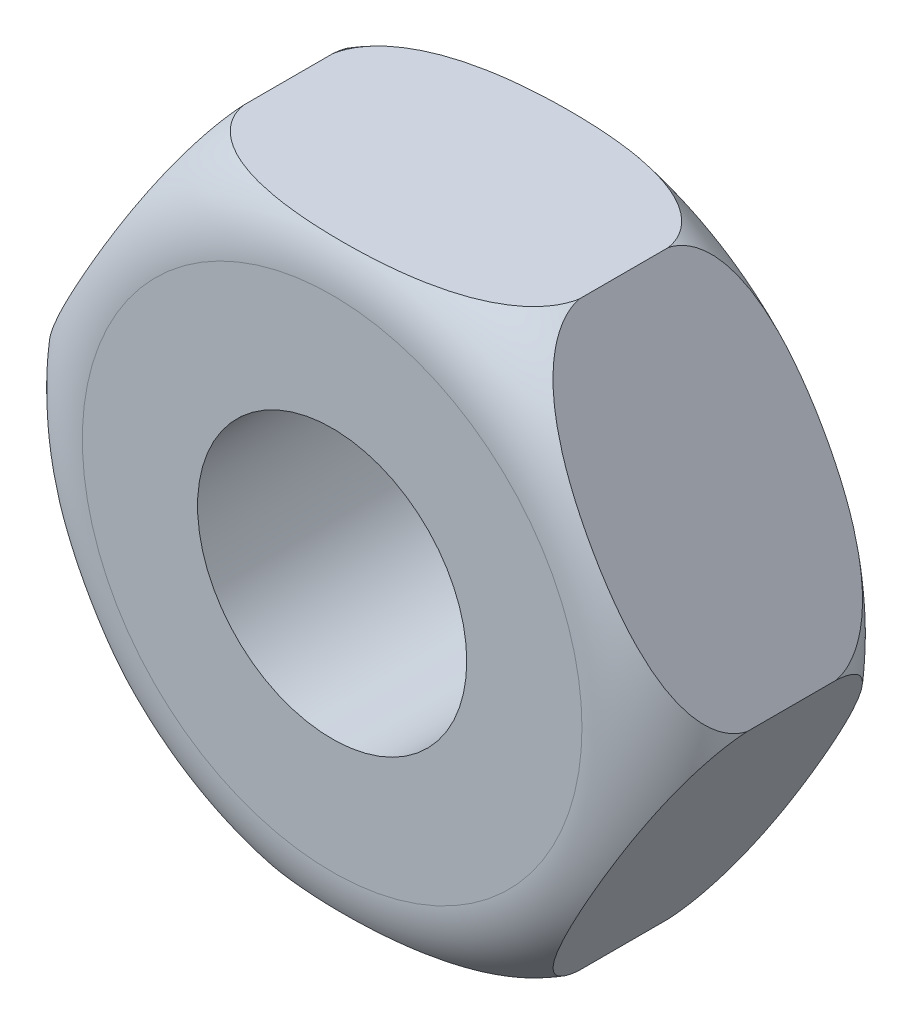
ISO-10303-21;
HEADER;
FILE_DESCRIPTION(('STEP AP214'),'2;1');
FILE_NAME('part.step','',(''),(''),'','','');
FILE_SCHEMA(('AUTOMOTIVE_DESIGN { 1 0 10303 214 1 1 1 1 }'));
ENDSEC;
DATA;
#1=APPLICATION_CONTEXT('core data for automotive mechanical design processes');
#2=APPLICATION_PROTOCOL_DEFINITION('international standard','automotive_design',2000,#1);
#3=PRODUCT_CONTEXT('',#1,'mechanical');
#4=PRODUCT('Part','Part','',(#3));
#5=PRODUCT_RELATED_PRODUCT_CATEGORY('part','',(#4));
#6=PRODUCT_DEFINITION_FORMATION('','',#4);
#7=PRODUCT_DEFINITION_CONTEXT('part definition',#1,'design');
#8=PRODUCT_DEFINITION('design','',#6,#7);
#9=PRODUCT_DEFINITION_SHAPE('','',#8);
#10=(LENGTH_UNIT() NAMED_UNIT(*) SI_UNIT(.MILLI.,.METRE.));
#11=(NAMED_UNIT(*) PLANE_ANGLE_UNIT() SI_UNIT($,.RADIAN.));
#12=(NAMED_UNIT(*) SI_UNIT($,.STERADIAN.) SOLID_ANGLE_UNIT());
#13=UNCERTAINTY_MEASURE_WITH_UNIT(LENGTH_MEASURE(1.E-05),#10,'distance_accuracy_value','');
#14=(GEOMETRIC_REPRESENTATION_CONTEXT(3) GLOBAL_UNCERTAINTY_ASSIGNED_CONTEXT((#13)) GLOBAL_UNIT_ASSIGNED_CONTEXT((#10,
#11,#12)) REPRESENTATION_CONTEXT('',''));
#15=CARTESIAN_POINT('',(0.,0.,0.));
#16=DIRECTION('',(0.,0.,1.));
#17=DIRECTION('',(1.,0.,0.));
#18=AXIS2_PLACEMENT_3D('',#15,#16,#17);
#19=CARTESIAN_POINT('',(0.,0.,2.3));
#20=DIRECTION('',(0.,0.,1.));
#21=DIRECTION('',(1.,0.,0.));
#22=AXIS2_PLACEMENT_3D('',#19,#20,#21);
#23=PLANE('',#22);
#24=CARTESIAN_POINT('',(0.,0.,2.3));
#25=DIRECTION('',(0.,0.,1.));
#26=DIRECTION('',(1.,0.,0.));
#27=AXIS2_PLACEMENT_3D('',#24,#25,#26);
#28=CIRCLE('',#27,2.32);
#29=CARTESIAN_POINT('',(2.32,0.,2.3));
#30=VERTEX_POINT('',#29);
#31=EDGE_CURVE('E109',#30,#30,#28,.T.);
#32=ORIENTED_EDGE('',*,*,#31,.T.);
#33=EDGE_LOOP('',(#32));
#34=FACE_BOUND('',#33,.T.);
#35=CARTESIAN_POINT('',(0.,0.,2.3));
#36=DIRECTION('',(0.,0.,1.));
#37=DIRECTION('',(1.,0.,0.));
#38=AXIS2_PLACEMENT_3D('',#35,#36,#37);
#39=CIRCLE('',#38,1.25);
#40=CARTESIAN_POINT('',(1.25,0.,2.3));
#41=VERTEX_POINT('',#40);
#42=EDGE_CURVE('E255',#41,#41,#39,.T.);
#43=ORIENTED_EDGE('',*,*,#42,.F.);
#44=EDGE_LOOP('',(#43));
#45=FACE_BOUND('',#44,.T.);
#46=ADVANCED_FACE('F46',(#34,#45),#23,.T.);
#47=CARTESIAN_POINT('',(0.,0.,0.));
#48=DIRECTION('',(0.,0.,1.));
#49=DIRECTION('',(1.,0.,0.));
#50=AXIS2_PLACEMENT_3D('',#47,#48,#49);
#51=PLANE('',#50);
#52=CARTESIAN_POINT('',(0.,0.,0.));
#53=DIRECTION('',(0.,0.,1.));
#54=DIRECTION('',(1.,0.,0.));
#55=AXIS2_PLACEMENT_3D('',#52,#53,#54);
#56=CIRCLE('',#55,2.32);
#57=CARTESIAN_POINT('',(2.32,0.,0.));
#58=VERTEX_POINT('',#57);
#59=EDGE_CURVE('E261',#58,#58,#56,.F.);
#60=ORIENTED_EDGE('',*,*,#59,.T.);
#61=EDGE_LOOP('',(#60));
#62=FACE_BOUND('',#61,.T.);
#63=CARTESIAN_POINT('',(0.,0.,0.));
#64=DIRECTION('',(0.,0.,1.));
#65=DIRECTION('',(1.,0.,0.));
#66=AXIS2_PLACEMENT_3D('',#63,#64,#65);
#67=CIRCLE('',#66,1.25);
#68=CARTESIAN_POINT('',(1.25,0.,0.));
#69=VERTEX_POINT('',#68);
#70=EDGE_CURVE('E252',#69,#69,#67,.T.);
#71=ORIENTED_EDGE('',*,*,#70,.T.);
#72=EDGE_LOOP('',(#71));
#73=FACE_BOUND('',#72,.T.);
#74=ADVANCED_FACE('F178',(#62,#73),#51,.F.);
#75=CARTESIAN_POINT('',(0.,0.,2.3));
#76=DIRECTION('',(0.,0.,-1.));
#77=DIRECTION('',(-1.,0.,0.));
#78=AXIS2_PLACEMENT_3D('',#75,#76,#77);
#79=CYLINDRICAL_SURFACE('',#78,1.25);
#80=ORIENTED_EDGE('',*,*,#42,.T.);
#81=EDGE_LOOP('',(#80));
#82=FACE_BOUND('',#81,.T.);
#83=ORIENTED_EDGE('',*,*,#70,.F.);
#84=EDGE_LOOP('',(#83));
#85=FACE_BOUND('',#84,.T.);
#86=ADVANCED_FACE('F176',(#82,#85),#79,.F.);
#87=CARTESIAN_POINT('',(0.,0.,0.8));
#88=DIRECTION('',(0.,0.,1.));
#89=DIRECTION('',(1.,0.,0.));
#90=AXIS2_PLACEMENT_3D('',#87,#88,#89);
#91=TOROIDAL_SURFACE('',#90,2.32,0.8);
#92=CARTESIAN_POINT('',(1.55873025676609,-2.70019999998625,0.740804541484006));
#93=CARTESIAN_POINT('',(1.56058913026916,-2.69698033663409,0.715469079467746));
#94=CARTESIAN_POINT('',(1.56367124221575,-2.69164196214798,0.690597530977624));
#95=CARTESIAN_POINT('',(1.57189350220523,-2.67740059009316,0.642530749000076));
#96=CARTESIAN_POINT('',(1.57701175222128,-2.66853552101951,0.619320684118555));
#97=CARTESIAN_POINT('',(1.59047098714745,-2.64522344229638,0.569188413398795));
#98=CARTESIAN_POINT('',(1.59929827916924,-2.6299341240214,0.542794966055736));
#99=CARTESIAN_POINT('',(1.61898264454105,-2.59583980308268,0.493120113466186));
#100=CARTESIAN_POINT('',(1.62984904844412,-2.577018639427,0.469853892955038));
#101=CARTESIAN_POINT('',(1.65900096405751,-2.52652604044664,0.415242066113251));
#102=CARTESIAN_POINT('',(1.67822360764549,-2.49323144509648,0.385913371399));
#103=CARTESIAN_POINT('',(1.71861684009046,-2.42326831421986,0.333422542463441));
#104=CARTESIAN_POINT('',(1.73978944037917,-2.38659629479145,0.310266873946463));
#105=CARTESIAN_POINT('',(1.78181308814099,-2.3138092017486,0.270415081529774));
#106=CARTESIAN_POINT('',(1.80258671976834,-2.27782821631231,0.253385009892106));
#107=CARTESIAN_POINT('',(1.84479071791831,-2.20472874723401,0.222910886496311));
#108=CARTESIAN_POINT('',(1.86622168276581,-2.16760922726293,0.209470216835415));
#109=CARTESIAN_POINT('',(1.90958393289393,-2.09250360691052,0.185493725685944));
#110=CARTESIAN_POINT('',(1.93151705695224,-2.0545143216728,0.174971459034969));
#111=CARTESIAN_POINT('',(1.97562872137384,-1.97811067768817,0.15639160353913));
#112=CARTESIAN_POINT('',(1.99780716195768,-1.93969649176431,0.148333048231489));
#113=CARTESIAN_POINT('',(2.04610947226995,-1.8560344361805,0.133056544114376));
#114=CARTESIAN_POINT('',(2.07226269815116,-1.81073572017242,0.126214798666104));
#115=CARTESIAN_POINT('',(2.12469602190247,-1.71991853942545,0.114821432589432));
#116=CARTESIAN_POINT('',(2.15097615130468,-1.67440002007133,0.110270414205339));
#117=CARTESIAN_POINT('',(2.22998542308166,-1.5375519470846,0.0994805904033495));
#118=CARTESIAN_POINT('',(2.2828137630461,-1.44605057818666,0.0961247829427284));
#119=CARTESIAN_POINT('',(2.38832216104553,-1.26330467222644,0.0959037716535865));
#120=CARTESIAN_POINT('',(2.44100221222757,-1.17206014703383,0.0990200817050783));
#121=CARTESIAN_POINT('',(2.5197993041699,-1.03557958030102,0.109359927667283));
#122=CARTESIAN_POINT('',(2.54600994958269,-0.9901814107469,0.113745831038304));
#123=CARTESIAN_POINT('',(2.5983104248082,-0.899594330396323,0.124765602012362));
#124=CARTESIAN_POINT('',(2.62440027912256,-0.854405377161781,0.131398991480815));
#125=CARTESIAN_POINT('',(2.67945928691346,-0.759040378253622,0.148340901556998));
#126=CARTESIAN_POINT('',(2.70840292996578,-0.708908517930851,0.158991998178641));
#127=CARTESIAN_POINT('',(2.76583001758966,-0.609441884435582,0.184653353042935));
#128=CARTESIAN_POINT('',(2.79431330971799,-0.560107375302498,0.199665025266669));
#129=CARTESIAN_POINT('',(2.85064229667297,-0.462542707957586,0.235456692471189));
#130=CARTESIAN_POINT('',(2.87848072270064,-0.414325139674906,0.256283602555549));
#131=CARTESIAN_POINT('',(2.93248834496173,-0.320781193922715,0.305339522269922));
#132=CARTESIAN_POINT('',(2.95866169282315,-0.27544762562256,0.333549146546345));
#133=CARTESIAN_POINT('',(2.99676279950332,-0.209454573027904,0.384504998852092));
#134=CARTESIAN_POINT('',(3.00978489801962,-0.186899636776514,0.40396299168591));
#135=CARTESIAN_POINT('',(3.0345111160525,-0.14407257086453,0.446077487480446));
#136=CARTESIAN_POINT('',(3.04621415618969,-0.123802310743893,0.468736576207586));
#137=CARTESIAN_POINT('',(3.06788538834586,-0.086266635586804,0.517764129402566));
#138=CARTESIAN_POINT('',(3.07782816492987,-0.0690452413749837,0.5441783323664));
#139=CARTESIAN_POINT('',(3.09500097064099,-0.0393010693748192,0.60027886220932));
#140=CARTESIAN_POINT('',(3.10224335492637,-0.0267568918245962,0.629949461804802));
#141=CARTESIAN_POINT('',(3.11006441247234,-0.0132104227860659,0.673775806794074));
#142=CARTESIAN_POINT('',(3.11207122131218,-0.0097345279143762,0.686943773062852));
#143=CARTESIAN_POINT('',(3.11543765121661,-0.00390370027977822,0.71363664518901));
#144=CARTESIAN_POINT('',(3.1167958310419,-0.00155126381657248,0.727162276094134));
#145=CARTESIAN_POINT('',(3.11780692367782,0.000199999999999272,0.74080454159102));
#146=B_SPLINE_CURVE_WITH_KNOTS('',3,(#92,#93,#94,#95,#96,#97,#98,#99,#100,#101,#102,#103,#104,
#105,#106,#107,#108,#109,#110,#111,#112,#113,#114,#115,#116,#117,#118,#119,#120,#121,#122,#123,
#124,#125,#126,#127,#128,#129,#130,#131,#132,#133,#134,#135,#136,#137,#138,#139,#140,#141,#142,
#143,#144,#145),.UNSPECIFIED.,.F.,.F.,(4,2,2,2,2,2,2,2,2,2,2,2,2,2,2,2,2,2,2,2,2,2,2,2,2,2,4),
(0.,0.0765491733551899,0.152296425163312,0.24703951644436,0.342227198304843,0.486478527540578,
0.630880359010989,0.765385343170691,0.900016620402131,1.03526311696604,1.17045649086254,
1.32864813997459,1.48688135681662,1.80376895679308,2.11975268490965,2.27752842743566,
2.43527062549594,2.61172183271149,2.78823032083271,2.96620613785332,3.14371923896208,
3.24104647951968,3.3384527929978,3.43716753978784,3.53542492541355,3.57666598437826,
3.61799825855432),.UNSPECIFIED.);
#147=CARTESIAN_POINT('',(1.55884572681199,-2.7,0.739268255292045));
#148=VERTEX_POINT('',#147);
#149=CARTESIAN_POINT('',(3.11769145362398,0.,0.739268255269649));
#150=VERTEX_POINT('',#149);
#151=EDGE_CURVE('E198',#148,#150,#146,.T.);
#152=ORIENTED_EDGE('',*,*,#151,.F.);
#153=CARTESIAN_POINT('',(0.,-2.7,0.0960113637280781));
#154=CARTESIAN_POINT('',(0.070843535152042,-2.7,0.0960133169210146));
#155=CARTESIAN_POINT('',(0.141685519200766,-2.7,0.0974987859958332));
#156=CARTESIAN_POINT('',(0.283274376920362,-2.7,0.103664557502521));
#157=CARTESIAN_POINT('',(0.354021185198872,-2.7,0.108346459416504));
#158=CARTESIAN_POINT('',(0.494705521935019,-2.7,0.121528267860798));
#159=CARTESIAN_POINT('',(0.564645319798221,-2.7,0.130003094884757));
#160=CARTESIAN_POINT('',(0.703724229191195,-2.7,0.151883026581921));
#161=CARTESIAN_POINT('',(0.772864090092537,-2.7,0.165283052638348));
#162=CARTESIAN_POINT('',(0.888647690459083,-2.7,0.193598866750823));
#163=CARTESIAN_POINT('',(0.935705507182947,-2.7,0.20679818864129));
#164=CARTESIAN_POINT('',(1.02863313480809,-2.7,0.237192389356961));
#165=CARTESIAN_POINT('',(1.07450086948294,-2.7,0.254393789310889));
#166=CARTESIAN_POINT('',(1.16448018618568,-2.7,0.293885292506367));
#167=CARTESIAN_POINT('',(1.20857450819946,-2.7,0.316215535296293));
#168=CARTESIAN_POINT('',(1.29308111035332,-2.7,0.367037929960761));
#169=CARTESIAN_POINT('',(1.33350212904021,-2.7,0.395514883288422));
#170=CARTESIAN_POINT('',(1.3936204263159,-2.7,0.447269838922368));
#171=CARTESIAN_POINT('',(1.41526887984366,-2.7,0.468270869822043));
#172=CARTESIAN_POINT('',(1.45535653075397,-2.7,0.513164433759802));
#173=CARTESIAN_POINT('',(1.4737988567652,-2.7,0.537054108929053));
#174=CARTESIAN_POINT('',(1.50398277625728,-2.7,0.583934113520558));
#175=CARTESIAN_POINT('',(1.51631020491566,-2.7,0.606543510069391));
#176=CARTESIAN_POINT('',(1.5370516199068,-2.7,0.653505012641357));
#177=CARTESIAN_POINT('',(1.54546830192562,-2.7,0.677855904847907));
#178=CARTESIAN_POINT('',(1.55775942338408,-2.7,0.727885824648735));
#179=CARTESIAN_POINT('',(1.56160082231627,-2.7,0.753573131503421));
#180=CARTESIAN_POINT('',(1.56425458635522,-2.7,0.805204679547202));
#181=CARTESIAN_POINT('',(1.56306893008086,-2.7,0.831148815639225));
#182=CARTESIAN_POINT('',(1.55622991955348,-2.7,0.879289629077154));
#183=CARTESIAN_POINT('',(1.55112129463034,-2.7,0.901566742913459));
#184=CARTESIAN_POINT('',(1.5374672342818,-2.7,0.94503114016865));
#185=CARTESIAN_POINT('',(1.52892078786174,-2.7,0.966218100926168));
#186=CARTESIAN_POINT('',(1.50552193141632,-2.7,1.01402159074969));
#187=CARTESIAN_POINT('',(1.48951567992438,-2.7,1.04007213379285));
#188=CARTESIAN_POINT('',(1.4535071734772,-2.7,1.08924264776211));
#189=CARTESIAN_POINT('',(1.43349682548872,-2.7,1.11235652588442));
#190=CARTESIAN_POINT('',(1.38006740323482,-2.7,1.16624696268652));
#191=CARTESIAN_POINT('',(1.34487318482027,-2.7,1.19525125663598));
#192=CARTESIAN_POINT('',(1.27052730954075,-2.7,1.24755805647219));
#193=CARTESIAN_POINT('',(1.23136828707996,-2.7,1.27084966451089));
#194=CARTESIAN_POINT('',(1.15441959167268,-2.7,1.31069661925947));
#195=CARTESIAN_POINT('',(1.11684633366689,-2.7,1.32767902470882));
#196=CARTESIAN_POINT('',(1.04037133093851,-2.7,1.35837056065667));
#197=CARTESIAN_POINT('',(1.00146844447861,-2.7,1.37207679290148));
#198=CARTESIAN_POINT('',(0.88330919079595,-2.7,1.40916714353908));
#199=CARTESIAN_POINT('',(0.802773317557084,-2.7,1.42844199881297));
#200=CARTESIAN_POINT('',(0.628082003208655,-2.7,1.46169513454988));
#201=CARTESIAN_POINT('',(0.533710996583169,-2.7,1.47442928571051));
#202=CARTESIAN_POINT('',(0.344195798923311,-2.7,1.49290724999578));
#203=CARTESIAN_POINT('',(0.249050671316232,-2.7,1.49864070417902));
#204=CARTESIAN_POINT('',(0.0582983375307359,-2.7,1.50458398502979));
#205=CARTESIAN_POINT('',(-0.0373093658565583,-2.7,1.50477581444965));
#206=CARTESIAN_POINT('',(-0.228305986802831,-2.7,1.49965784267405));
#207=CARTESIAN_POINT('',(-0.323695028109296,-2.7,1.49435366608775));
#208=CARTESIAN_POINT('',(-0.475662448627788,-2.7,1.48033349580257));
#209=CARTESIAN_POINT('',(-0.532444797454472,-2.7,1.47384271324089));
#210=CARTESIAN_POINT('',(-0.645566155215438,-2.7,1.45778564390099));
#211=CARTESIAN_POINT('',(-0.701905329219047,-2.7,1.44822056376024));
#212=CARTESIAN_POINT('',(-0.813422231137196,-2.7,1.42529603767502));
#213=CARTESIAN_POINT('',(-0.868605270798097,-2.7,1.41196302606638));
#214=CARTESIAN_POINT('',(-0.977537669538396,-2.7,1.3804341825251));
#215=CARTESIAN_POINT('',(-1.03128900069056,-2.7,1.3622454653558));
#216=CARTESIAN_POINT('',(-1.11868213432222,-2.7,1.32676977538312));
#217=CARTESIAN_POINT('',(-1.15302564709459,-2.7,1.31122388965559));
#218=CARTESIAN_POINT('',(-1.22012066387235,-2.7,1.27684489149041));
#219=CARTESIAN_POINT('',(-1.25286980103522,-2.7,1.25800707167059));
#220=CARTESIAN_POINT('',(-1.31615717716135,-2.7,1.21635680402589));
#221=CARTESIAN_POINT('',(-1.34667551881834,-2.7,1.19351361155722));
#222=CARTESIAN_POINT('',(-1.40390136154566,-2.7,1.14344920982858));
#223=CARTESIAN_POINT('',(-1.43061636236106,-2.7,1.11623684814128));
#224=CARTESIAN_POINT('',(-1.47130360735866,-2.7,1.06597208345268));
#225=CARTESIAN_POINT('',(-1.48670440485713,-2.7,1.04408278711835));
#226=CARTESIAN_POINT('',(-1.51389963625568,-2.7,0.998146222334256));
#227=CARTESIAN_POINT('',(-1.52569626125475,-2.7,0.974100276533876));
#228=CARTESIAN_POINT('',(-1.54492281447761,-2.7,0.924022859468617));
#229=CARTESIAN_POINT('',(-1.55230967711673,-2.7,0.897974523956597));
#230=CARTESIAN_POINT('',(-1.56182460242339,-2.7,0.844934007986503));
#231=CARTESIAN_POINT('',(-1.56395761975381,-2.7,0.817942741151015));
#232=CARTESIAN_POINT('',(-1.56283549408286,-2.7,0.767633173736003));
#233=CARTESIAN_POINT('',(-1.56025006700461,-2.7,0.744297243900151));
#234=CARTESIAN_POINT('',(-1.55116914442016,-2.7,0.698404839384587));
#235=CARTESIAN_POINT('',(-1.54467300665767,-2.7,0.675848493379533));
#236=CARTESIAN_POINT('',(-1.52826263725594,-2.7,0.632132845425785));
#237=CARTESIAN_POINT('',(-1.51836133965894,-2.7,0.61096861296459));
#238=CARTESIAN_POINT('',(-1.49570303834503,-2.7,0.570244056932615));
#239=CARTESIAN_POINT('',(-1.48294481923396,-2.7,0.550684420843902));
#240=CARTESIAN_POINT('',(-1.44673135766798,-2.7,0.502009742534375));
#241=CARTESIAN_POINT('',(-1.4214638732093,-2.7,0.474242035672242));
#242=CARTESIAN_POINT('',(-1.36689120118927,-2.7,0.42301352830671));
#243=CARTESIAN_POINT('',(-1.33757533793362,-2.7,0.39956451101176));
#244=CARTESIAN_POINT('',(-1.25639684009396,-2.7,0.342584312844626));
#245=CARTESIAN_POINT('',(-1.20223111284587,-2.7,0.312362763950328));
#246=CARTESIAN_POINT('',(-1.09016333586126,-2.7,0.260089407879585));
#247=CARTESIAN_POINT('',(-1.03225258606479,-2.7,0.238057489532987));
#248=CARTESIAN_POINT('',(-0.895561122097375,-2.7,0.194149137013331));
#249=CARTESIAN_POINT('',(-0.816051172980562,-2.7,0.174595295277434));
#250=CARTESIAN_POINT('',(-0.65548238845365,-2.7,0.143093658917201));
#251=CARTESIAN_POINT('',(-0.574420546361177,-2.7,0.131162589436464));
#252=CARTESIAN_POINT('',(-0.411199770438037,-2.7,0.112799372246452));
#253=CARTESIAN_POINT('',(-0.329037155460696,-2.7,0.106401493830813));
#254=CARTESIAN_POINT('',(-0.164582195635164,-2.7,0.0980084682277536));
#255=CARTESIAN_POINT('',(-0.0822900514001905,-2.7,0.0960090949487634));
#256=CARTESIAN_POINT('',(0.,-2.7,0.0960113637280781));
#257=B_SPLINE_CURVE_WITH_KNOTS('',3,(#153,#154,#155,#156,#157,#158,#159,#160,#161,#162,#163,
#164,#165,#166,#167,#168,#169,#170,#171,#172,#173,#174,#175,#176,#177,#178,#179,#180,#181,#182,
#183,#184,#185,#186,#187,#188,#189,#190,#191,#192,#193,#194,#195,#196,#197,#198,#199,#200,#201,
#202,#203,#204,#205,#206,#207,#208,#209,#210,#211,#212,#213,#214,#215,#216,#217,#218,#219,#220,
#221,#222,#223,#224,#225,#226,#227,#228,#229,#230,#231,#232,#233,#234,#235,#236,#237,#238,#239,
#240,#241,#242,#243,#244,#245,#246,#247,#248,#249,#250,#251,#252,#253,#254,#255,#256),
.UNSPECIFIED.,.T.,.F.,(4,2,2,2,2,2,2,2,2,2,2,2,2,2,2,2,2,2,2,2,2,2,2,2,2,2,2,2,2,2,2,2,2,2,2,2,
2,2,2,2,2,2,2,2,2,2,2,2,2,2,2,4),(0.,0.21251136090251,0.425129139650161,0.636361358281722,
0.847376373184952,0.993866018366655,1.14059605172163,1.28851611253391,1.43607452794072,
1.52631806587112,1.61647304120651,1.69342089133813,1.7703156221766,1.847762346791,
1.92517859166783,1.99344289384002,2.06172728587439,2.15294280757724,2.24434458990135,
2.38039471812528,2.51670239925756,2.64021708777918,2.76384064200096,3.01164982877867,
3.2969864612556,3.58274479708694,3.86943107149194,4.15582424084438,4.32721855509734,
4.49854568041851,4.66869947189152,4.83860530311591,4.95156343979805,5.06468444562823,
5.1787151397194,5.29251776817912,5.37253771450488,5.45250891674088,5.53324885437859,
5.61391262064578,5.68400155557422,5.7541020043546,5.82393907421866,5.89380591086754,
6.00578843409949,6.11807210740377,6.30309645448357,6.48856724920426,6.73360647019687,
6.97918150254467,7.2262668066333,7.4731146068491),.UNSPECIFIED.);
#258=CARTESIAN_POINT('',(-1.55884572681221,-2.7,0.73926825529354));
#259=VERTEX_POINT('',#258);
#260=EDGE_CURVE('E162',#259,#148,#257,.T.);
#261=ORIENTED_EDGE('',*,*,#260,.F.);
#262=CARTESIAN_POINT('',(-3.11780692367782,0.000199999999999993,0.740804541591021));
#263=CARTESIAN_POINT('',(-3.11594805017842,-0.00301966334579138,0.715469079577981));
#264=CARTESIAN_POINT('',(-3.11286593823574,-0.0083580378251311,0.690597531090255));
#265=CARTESIAN_POINT('',(-3.10464367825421,-0.0225994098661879,0.642530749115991));
#266=CARTESIAN_POINT('',(-3.09952542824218,-0.03146447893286,0.619320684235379));
#267=CARTESIAN_POINT('',(-3.0860661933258,-0.0547765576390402,0.569188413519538));
#268=CARTESIAN_POINT('',(-3.07723890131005,-0.0700658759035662,0.542794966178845));
#269=CARTESIAN_POINT('',(-3.05755453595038,-0.104160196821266,0.493120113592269));
#270=CARTESIAN_POINT('',(-3.04668813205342,-0.122981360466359,0.469853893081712));
#271=CARTESIAN_POINT('',(-3.01753621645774,-0.173473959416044,0.415242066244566));
#272=CARTESIAN_POINT('',(-2.99831357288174,-0.206768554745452,0.385913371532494));
#273=CARTESIAN_POINT('',(-2.95792034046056,-0.276731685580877,0.333422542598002));
#274=CARTESIAN_POINT('',(-2.93674774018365,-0.313403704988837,0.31026687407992));
#275=CARTESIAN_POINT('',(-2.89472409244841,-0.386190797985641,0.270415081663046));
#276=CARTESIAN_POINT('',(-2.87395046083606,-0.42217178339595,0.25338501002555));
#277=CARTESIAN_POINT('',(-2.83174646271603,-0.495271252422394,0.222910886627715));
#278=CARTESIAN_POINT('',(-2.81031549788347,-0.532390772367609,0.209470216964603));
#279=CARTESIAN_POINT('',(-2.76695324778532,-0.607496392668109,0.185493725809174));
#280=CARTESIAN_POINT('',(-2.74502012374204,-0.645485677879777,0.174971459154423));
#281=CARTESIAN_POINT('',(-2.70090845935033,-0.721889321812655,0.15639160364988));
#282=CARTESIAN_POINT('',(-2.67873001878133,-0.760303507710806,0.148333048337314));
#283=CARTESIAN_POINT('',(-2.63042770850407,-0.843965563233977,0.133056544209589));
#284=CARTESIAN_POINT('',(-2.60427448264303,-0.889264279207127,0.126214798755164));
#285=CARTESIAN_POINT('',(-2.55184115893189,-0.980081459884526,0.11482143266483));
#286=CARTESIAN_POINT('',(-2.52556102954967,-1.025599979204,0.11027041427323));
#287=CARTESIAN_POINT('',(-2.44655175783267,-1.16244805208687,0.0994805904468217));
#288=CARTESIAN_POINT('',(-2.39372341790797,-1.25394942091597,0.0961247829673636));
#289=CARTESIAN_POINT('',(-2.28821501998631,-1.43669532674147,0.0959037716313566));
#290=CARTESIAN_POINT('',(-2.23553496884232,-1.5279398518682,0.0990200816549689));
#291=CARTESIAN_POINT('',(-2.15673787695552,-1.66442041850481,0.109359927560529));
#292=CARTESIAN_POINT('',(-2.1305272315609,-1.70981858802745,0.113745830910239));
#293=CARTESIAN_POINT('',(-2.07822675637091,-1.80040566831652,0.124765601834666));
#294=CARTESIAN_POINT('',(-2.05213690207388,-1.84559462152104,0.131398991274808));
#295=CARTESIAN_POINT('',(-1.99707789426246,-1.94095962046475,0.148340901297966));
#296=CARTESIAN_POINT('',(-1.96813425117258,-1.99109148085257,0.158991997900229));
#297=CARTESIAN_POINT('',(-1.91070716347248,-2.09055811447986,0.184653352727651));
#298=CARTESIAN_POINT('',(-1.88222387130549,-2.1398926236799,0.199665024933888));
#299=CARTESIAN_POINT('',(-1.82589488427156,-2.23745729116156,0.235456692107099));
#300=CARTESIAN_POINT('',(-1.79805645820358,-2.28567485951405,0.256283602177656));
#301=CARTESIAN_POINT('',(-1.74404883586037,-2.37921880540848,0.30533952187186));
#302=CARTESIAN_POINT('',(-1.71787548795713,-2.42455237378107,0.333549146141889));
#303=CARTESIAN_POINT('',(-1.67977438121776,-2.49054542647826,0.384504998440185));
#304=CARTESIAN_POINT('',(-1.66675228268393,-2.51310036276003,0.403962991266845));
#305=CARTESIAN_POINT('',(-1.64202606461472,-2.55592742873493,0.446077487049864));
#306=CARTESIAN_POINT('',(-1.63032302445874,-2.5761976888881,0.468736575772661));
#307=CARTESIAN_POINT('',(-1.60865179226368,-2.61373336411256,0.517764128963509));
#308=CARTESIAN_POINT('',(-1.59870901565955,-2.63095475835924,0.544178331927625));
#309=CARTESIAN_POINT('',(-1.58153620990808,-2.66069893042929,0.600278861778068));
#310=CARTESIAN_POINT('',(-1.57429382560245,-2.67324310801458,0.629949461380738));
#311=CARTESIAN_POINT('',(-1.56647276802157,-2.68678957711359,0.673775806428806));
#312=CARTESIAN_POINT('',(-1.56446595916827,-2.69026547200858,0.686943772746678));
#313=CARTESIAN_POINT('',(-1.56109952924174,-2.69609629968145,0.713636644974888));
#314=CARTESIAN_POINT('',(-1.55974134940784,-2.69844873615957,0.727162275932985));
#315=CARTESIAN_POINT('',(-1.55873025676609,-2.70019999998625,0.740804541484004));
#316=B_SPLINE_CURVE_WITH_KNOTS('',3,(#262,#263,#264,#265,#266,#267,#268,#269,#270,#271,#272,
#273,#274,#275,#276,#277,#278,#279,#280,#281,#282,#283,#284,#285,#286,#287,#288,#289,#290,#291,
#292,#293,#294,#295,#296,#297,#298,#299,#300,#301,#302,#303,#304,#305,#306,#307,#308,#309,#310,
#311,#312,#313,#314,#315),.UNSPECIFIED.,.F.,.F.,(4,2,2,2,2,2,2,2,2,2,2,2,2,2,2,2,2,2,2,2,2,2,2,
2,2,2,4),(0.,0.0765491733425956,0.152296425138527,0.247039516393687,0.342227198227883,
0.486478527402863,0.630880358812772,0.76538534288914,0.900016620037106,1.03526311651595,
1.17045649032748,1.32864813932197,1.48688135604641,1.80376895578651,2.11975268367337,
2.27752842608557,2.43527062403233,2.61172183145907,2.78823031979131,2.96620613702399,
3.14371923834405,3.24104647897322,3.33845279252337,3.43716753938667,3.53542492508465,
3.57666598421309,3.61799825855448),.UNSPECIFIED.);
#317=CARTESIAN_POINT('',(-3.11769145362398,0.,0.739268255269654));
#318=VERTEX_POINT('',#317);
#319=EDGE_CURVE('E116',#318,#259,#316,.T.);
#320=ORIENTED_EDGE('',*,*,#319,.F.);
#321=CARTESIAN_POINT('',(-1.55873025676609,2.70019999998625,0.740804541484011));
#322=CARTESIAN_POINT('',(-1.56058913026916,2.69698033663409,0.715469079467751));
#323=CARTESIAN_POINT('',(-1.56367124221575,2.69164196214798,0.690597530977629));
#324=CARTESIAN_POINT('',(-1.57189350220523,2.67740059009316,0.642530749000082));
#325=CARTESIAN_POINT('',(-1.57701175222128,2.66853552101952,0.61932068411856));
#326=CARTESIAN_POINT('',(-1.59047098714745,2.64522344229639,0.569188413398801));
#327=CARTESIAN_POINT('',(-1.59929827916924,2.62993412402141,0.542794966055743));
#328=CARTESIAN_POINT('',(-1.61898264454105,2.59583980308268,0.493120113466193));
#329=CARTESIAN_POINT('',(-1.62984904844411,2.57701863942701,0.469853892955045));
#330=CARTESIAN_POINT('',(-1.65900096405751,2.52652604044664,0.415242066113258));
#331=CARTESIAN_POINT('',(-1.67822360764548,2.49323144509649,0.385913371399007));
#332=CARTESIAN_POINT('',(-1.71861684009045,2.42326831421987,0.333422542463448));
#333=CARTESIAN_POINT('',(-1.73978944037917,2.38659629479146,0.310266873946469));
#334=CARTESIAN_POINT('',(-1.78181308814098,2.31380920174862,0.270415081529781));
#335=CARTESIAN_POINT('',(-1.80258671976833,2.27782821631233,0.253385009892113));
#336=CARTESIAN_POINT('',(-1.8447907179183,2.20472874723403,0.222910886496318));
#337=CARTESIAN_POINT('',(-1.8662216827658,2.16760922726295,0.209470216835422));
#338=CARTESIAN_POINT('',(-1.90958393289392,2.09250360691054,0.18549372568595));
#339=CARTESIAN_POINT('',(-1.93151705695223,2.05451432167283,0.174971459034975));
#340=CARTESIAN_POINT('',(-1.97562872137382,1.9781106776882,0.156391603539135));
#341=CARTESIAN_POINT('',(-1.99780716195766,1.93969649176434,0.148333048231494));
#342=CARTESIAN_POINT('',(-2.04610947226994,1.85603443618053,0.133056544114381));
#343=CARTESIAN_POINT('',(-2.07226269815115,1.81073572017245,0.126214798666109));
#344=CARTESIAN_POINT('',(-2.12469602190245,1.71991853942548,0.114821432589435));
#345=CARTESIAN_POINT('',(-2.15097615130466,1.67440002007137,0.110270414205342));
#346=CARTESIAN_POINT('',(-2.22998542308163,1.53755194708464,0.0994805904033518));
#347=CARTESIAN_POINT('',(-2.28281376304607,1.44605057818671,0.0961247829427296));
#348=CARTESIAN_POINT('',(-2.3883221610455,1.2633046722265,0.0959037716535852));
#349=CARTESIAN_POINT('',(-2.44100221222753,1.17206014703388,0.0990200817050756));
#350=CARTESIAN_POINT('',(-2.51979930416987,1.03557958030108,0.109359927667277));
#351=CARTESIAN_POINT('',(-2.54600994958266,0.990181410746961,0.113745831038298));
#352=CARTESIAN_POINT('',(-2.59831042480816,0.899594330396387,0.124765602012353));
#353=CARTESIAN_POINT('',(-2.62440027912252,0.854405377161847,0.131398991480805));
#354=CARTESIAN_POINT('',(-2.67945928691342,0.759040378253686,0.148340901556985));
#355=CARTESIAN_POINT('',(-2.70840292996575,0.708908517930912,0.158991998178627));
#356=CARTESIAN_POINT('',(-2.76583001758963,0.609441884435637,0.184653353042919));
#357=CARTESIAN_POINT('',(-2.79431330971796,0.56010737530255,0.199665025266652));
#358=CARTESIAN_POINT('',(-2.85064229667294,0.462542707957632,0.23545669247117));
#359=CARTESIAN_POINT('',(-2.87848072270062,0.414325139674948,0.256283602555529));
#360=CARTESIAN_POINT('',(-2.93248834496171,0.320781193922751,0.3053395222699));
#361=CARTESIAN_POINT('',(-2.95866169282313,0.275447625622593,0.333549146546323));
#362=CARTESIAN_POINT('',(-2.99676279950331,0.209454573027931,0.384504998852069));
#363=CARTESIAN_POINT('',(-3.0097848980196,0.18689963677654,0.403962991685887));
#364=CARTESIAN_POINT('',(-3.03451111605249,0.144072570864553,0.446077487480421));
#365=CARTESIAN_POINT('',(-3.04621415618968,0.123802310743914,0.468736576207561));
#366=CARTESIAN_POINT('',(-3.06788538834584,0.0862666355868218,0.51776412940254));
#367=CARTESIAN_POINT('',(-3.07782816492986,0.0690452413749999,0.544178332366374));
#368=CARTESIAN_POINT('',(-3.09500097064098,0.0393010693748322,0.600278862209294));
#369=CARTESIAN_POINT('',(-3.10224335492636,0.0267568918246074,0.629949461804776));
#370=CARTESIAN_POINT('',(-3.11006441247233,0.0132104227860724,0.673775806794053));
#371=CARTESIAN_POINT('',(-3.11207122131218,0.00973452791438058,0.686943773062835));
#372=CARTESIAN_POINT('',(-3.11543765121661,0.00390370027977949,0.713636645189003));
#373=CARTESIAN_POINT('',(-3.1167958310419,0.00155126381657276,0.727162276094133));
#374=CARTESIAN_POINT('',(-3.11780692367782,-0.000199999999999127,0.740804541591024));
#375=B_SPLINE_CURVE_WITH_KNOTS('',3,(#321,#322,#323,#324,#325,#326,#327,#328,#329,#330,#331,
#332,#333,#334,#335,#336,#337,#338,#339,#340,#341,#342,#343,#344,#345,#346,#347,#348,#349,#350,
#351,#352,#353,#354,#355,#356,#357,#358,#359,#360,#361,#362,#363,#364,#365,#366,#367,#368,#369,
#370,#371,#372,#373,#374),.UNSPECIFIED.,.F.,.F.,(4,2,2,2,2,2,2,2,2,2,2,2,2,2,2,2,2,2,2,2,2,2,2,
2,2,2,4),(0.,0.0765491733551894,0.15229642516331,0.247039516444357,0.34222719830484,
0.486478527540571,0.63088035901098,0.765385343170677,0.900016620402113,1.03526311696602,
1.17045649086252,1.32864813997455,1.48688135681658,1.80376895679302,2.11975268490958,
2.27752842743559,2.43527062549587,2.61172183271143,2.78823032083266,2.96620613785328,
3.14371923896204,3.24104647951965,3.33845279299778,3.43716753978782,3.53542492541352,
3.57666598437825,3.61799825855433),.UNSPECIFIED.);
#376=CARTESIAN_POINT('',(-1.55884572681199,2.7,0.739268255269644));
#377=VERTEX_POINT('',#376);
#378=EDGE_CURVE('E161',#377,#318,#375,.T.);
#379=ORIENTED_EDGE('',*,*,#378,.F.);
#380=CARTESIAN_POINT('',(0.,2.7,0.0960113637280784));
#381=CARTESIAN_POINT('',(-0.0708435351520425,2.7,0.0960133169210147));
#382=CARTESIAN_POINT('',(-0.141685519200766,2.7,0.0974987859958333));
#383=CARTESIAN_POINT('',(-0.283274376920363,2.7,0.103664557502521));
#384=CARTESIAN_POINT('',(-0.354021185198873,2.7,0.108346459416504));
#385=CARTESIAN_POINT('',(-0.49470552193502,2.7,0.121528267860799));
#386=CARTESIAN_POINT('',(-0.564645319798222,2.7,0.130003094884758));
#387=CARTESIAN_POINT('',(-0.703724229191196,2.7,0.151883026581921));
#388=CARTESIAN_POINT('',(-0.772864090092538,2.7,0.165283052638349));
#389=CARTESIAN_POINT('',(-0.888647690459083,2.7,0.193598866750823));
#390=CARTESIAN_POINT('',(-0.935705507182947,2.7,0.20679818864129));
#391=CARTESIAN_POINT('',(-1.02863313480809,2.7,0.237192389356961));
#392=CARTESIAN_POINT('',(-1.07450086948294,2.7,0.25439378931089));
#393=CARTESIAN_POINT('',(-1.16448018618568,2.7,0.293885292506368));
#394=CARTESIAN_POINT('',(-1.20857450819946,2.7,0.316215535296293));
#395=CARTESIAN_POINT('',(-1.29308111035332,2.7,0.367037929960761));
#396=CARTESIAN_POINT('',(-1.33350212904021,2.7,0.395514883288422));
#397=CARTESIAN_POINT('',(-1.3936204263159,2.7,0.447269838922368));
#398=CARTESIAN_POINT('',(-1.41526887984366,2.7,0.468270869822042));
#399=CARTESIAN_POINT('',(-1.45535653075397,2.7,0.513164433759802));
#400=CARTESIAN_POINT('',(-1.4737988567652,2.7,0.537054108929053));
#401=CARTESIAN_POINT('',(-1.50398277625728,2.7,0.583934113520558));
#402=CARTESIAN_POINT('',(-1.51631020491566,2.7,0.606543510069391));
#403=CARTESIAN_POINT('',(-1.5370516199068,2.7,0.653505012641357));
#404=CARTESIAN_POINT('',(-1.54546830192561,2.7,0.677855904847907));
#405=CARTESIAN_POINT('',(-1.55775942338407,2.7,0.727885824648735));
#406=CARTESIAN_POINT('',(-1.56160082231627,2.7,0.753573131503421));
#407=CARTESIAN_POINT('',(-1.56425458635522,2.7,0.805204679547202));
#408=CARTESIAN_POINT('',(-1.56306893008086,2.7,0.831148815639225));
#409=CARTESIAN_POINT('',(-1.55622991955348,2.7,0.879289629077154));
#410=CARTESIAN_POINT('',(-1.55112129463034,2.7,0.90156674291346));
#411=CARTESIAN_POINT('',(-1.5374672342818,2.7,0.94503114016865));
#412=CARTESIAN_POINT('',(-1.52892078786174,2.7,0.966218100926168));
#413=CARTESIAN_POINT('',(-1.50552193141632,2.7,1.01402159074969));
#414=CARTESIAN_POINT('',(-1.48951567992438,2.7,1.04007213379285));
#415=CARTESIAN_POINT('',(-1.4535071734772,2.7,1.08924264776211));
#416=CARTESIAN_POINT('',(-1.43349682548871,2.7,1.11235652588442));
#417=CARTESIAN_POINT('',(-1.38006740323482,2.7,1.16624696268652));
#418=CARTESIAN_POINT('',(-1.34487318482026,2.7,1.19525125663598));
#419=CARTESIAN_POINT('',(-1.27052730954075,2.7,1.24755805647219));
#420=CARTESIAN_POINT('',(-1.23136828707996,2.7,1.27084966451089));
#421=CARTESIAN_POINT('',(-1.15441959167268,2.7,1.31069661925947));
#422=CARTESIAN_POINT('',(-1.11684633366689,2.7,1.32767902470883));
#423=CARTESIAN_POINT('',(-1.04037133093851,2.7,1.35837056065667));
#424=CARTESIAN_POINT('',(-1.00146844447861,2.7,1.37207679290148));
#425=CARTESIAN_POINT('',(-0.883309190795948,2.7,1.40916714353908));
#426=CARTESIAN_POINT('',(-0.802773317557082,2.7,1.42844199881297));
#427=CARTESIAN_POINT('',(-0.628082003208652,2.7,1.46169513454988));
#428=CARTESIAN_POINT('',(-0.533710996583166,2.7,1.47442928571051));
#429=CARTESIAN_POINT('',(-0.344195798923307,2.7,1.49290724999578));
#430=CARTESIAN_POINT('',(-0.249050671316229,2.7,1.49864070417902));
#431=CARTESIAN_POINT('',(-0.0582983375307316,2.7,1.50458398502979));
#432=CARTESIAN_POINT('',(0.0373093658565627,2.7,1.50477581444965));
#433=CARTESIAN_POINT('',(0.228305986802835,2.7,1.49965784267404));
#434=CARTESIAN_POINT('',(0.323695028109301,2.7,1.49435366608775));
#435=CARTESIAN_POINT('',(0.475662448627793,2.7,1.48033349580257));
#436=CARTESIAN_POINT('',(0.532444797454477,2.7,1.47384271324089));
#437=CARTESIAN_POINT('',(0.645566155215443,2.7,1.45778564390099));
#438=CARTESIAN_POINT('',(0.701905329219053,2.7,1.44822056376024));
#439=CARTESIAN_POINT('',(0.813422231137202,2.7,1.42529603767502));
#440=CARTESIAN_POINT('',(0.868605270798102,2.7,1.41196302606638));
#441=CARTESIAN_POINT('',(0.977537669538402,2.7,1.38043418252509));
#442=CARTESIAN_POINT('',(1.03128900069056,2.7,1.36224546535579));
#443=CARTESIAN_POINT('',(1.11868213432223,2.7,1.32676977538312));
#444=CARTESIAN_POINT('',(1.1530256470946,2.7,1.31122388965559));
#445=CARTESIAN_POINT('',(1.22012066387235,2.7,1.2768448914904));
#446=CARTESIAN_POINT('',(1.25286980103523,2.7,1.25800707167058));
#447=CARTESIAN_POINT('',(1.31615717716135,2.7,1.21635680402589));
#448=CARTESIAN_POINT('',(1.34667551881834,2.7,1.19351361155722));
#449=CARTESIAN_POINT('',(1.40390136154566,2.7,1.14344920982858));
#450=CARTESIAN_POINT('',(1.43061636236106,2.7,1.11623684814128));
#451=CARTESIAN_POINT('',(1.47130360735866,2.7,1.06597208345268));
#452=CARTESIAN_POINT('',(1.48670440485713,2.7,1.04408278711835));
#453=CARTESIAN_POINT('',(1.51389963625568,2.7,0.998146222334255));
#454=CARTESIAN_POINT('',(1.52569626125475,2.7,0.974100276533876));
#455=CARTESIAN_POINT('',(1.54492281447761,2.7,0.924022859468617));
#456=CARTESIAN_POINT('',(1.55230967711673,2.7,0.897974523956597));
#457=CARTESIAN_POINT('',(1.56182460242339,2.7,0.844934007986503));
#458=CARTESIAN_POINT('',(1.5639576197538,2.7,0.817942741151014));
#459=CARTESIAN_POINT('',(1.56283549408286,2.7,0.767633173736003));
#460=CARTESIAN_POINT('',(1.56025006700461,2.7,0.74429724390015));
#461=CARTESIAN_POINT('',(1.55116914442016,2.7,0.698404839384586));
#462=CARTESIAN_POINT('',(1.54467300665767,2.7,0.675848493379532));
#463=CARTESIAN_POINT('',(1.52826263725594,2.7,0.632132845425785));
#464=CARTESIAN_POINT('',(1.51836133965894,2.7,0.610968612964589));
#465=CARTESIAN_POINT('',(1.49570303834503,2.7,0.570244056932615));
#466=CARTESIAN_POINT('',(1.48294481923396,2.7,0.550684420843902));
#467=CARTESIAN_POINT('',(1.44673135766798,2.7,0.502009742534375));
#468=CARTESIAN_POINT('',(1.4214638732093,2.7,0.474242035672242));
#469=CARTESIAN_POINT('',(1.36689120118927,2.7,0.423013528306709));
#470=CARTESIAN_POINT('',(1.33757533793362,2.7,0.39956451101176));
#471=CARTESIAN_POINT('',(1.25639684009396,2.7,0.342584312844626));
#472=CARTESIAN_POINT('',(1.20223111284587,2.7,0.312362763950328));
#473=CARTESIAN_POINT('',(1.09016333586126,2.7,0.260089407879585));
#474=CARTESIAN_POINT('',(1.03225258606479,2.7,0.238057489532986));
#475=CARTESIAN_POINT('',(0.895561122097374,2.7,0.194149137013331));
#476=CARTESIAN_POINT('',(0.816051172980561,2.7,0.174595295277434));
#477=CARTESIAN_POINT('',(0.65548238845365,2.7,0.143093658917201));
#478=CARTESIAN_POINT('',(0.574420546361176,2.7,0.131162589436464));
#479=CARTESIAN_POINT('',(0.411199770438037,2.7,0.112799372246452));
#480=CARTESIAN_POINT('',(0.329037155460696,2.7,0.106401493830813));
#481=CARTESIAN_POINT('',(0.164582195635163,2.7,0.098008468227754));
#482=CARTESIAN_POINT('',(0.08229005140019,2.7,0.0960090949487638));
#483=CARTESIAN_POINT('',(0.,2.7,0.0960113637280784));
#484=B_SPLINE_CURVE_WITH_KNOTS('',3,(#380,#381,#382,#383,#384,#385,#386,#387,#388,#389,#390,
#391,#392,#393,#394,#395,#396,#397,#398,#399,#400,#401,#402,#403,#404,#405,#406,#407,#408,#409,
#410,#411,#412,#413,#414,#415,#416,#417,#418,#419,#420,#421,#422,#423,#424,#425,#426,#427,#428,
#429,#430,#431,#432,#433,#434,#435,#436,#437,#438,#439,#440,#441,#442,#443,#444,#445,#446,#447,
#448,#449,#450,#451,#452,#453,#454,#455,#456,#457,#458,#459,#460,#461,#462,#463,#464,#465,#466,
#467,#468,#469,#470,#471,#472,#473,#474,#475,#476,#477,#478,#479,#480,#481,#482,#483),
.UNSPECIFIED.,.T.,.F.,(4,2,2,2,2,2,2,2,2,2,2,2,2,2,2,2,2,2,2,2,2,2,2,2,2,2,2,2,2,2,2,2,2,2,2,2,
2,2,2,2,2,2,2,2,2,2,2,2,2,2,2,4),(0.,0.21251136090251,0.425129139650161,0.636361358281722,
0.847376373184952,0.993866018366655,1.14059605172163,1.28851611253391,1.43607452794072,
1.52631806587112,1.61647304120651,1.69342089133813,1.7703156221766,1.847762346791,
1.92517859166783,1.99344289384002,2.06172728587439,2.15294280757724,2.24434458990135,
2.38039471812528,2.51670239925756,2.64021708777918,2.76384064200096,3.01164982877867,
3.2969864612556,3.58274479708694,3.86943107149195,4.15582424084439,4.32721855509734,
4.49854568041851,4.66869947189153,4.83860530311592,4.95156343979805,5.06468444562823,
5.1787151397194,5.29251776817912,5.37253771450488,5.45250891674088,5.53324885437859,
5.61391262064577,5.68400155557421,5.7541020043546,5.82393907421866,5.89380591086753,
6.00578843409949,6.11807210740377,6.30309645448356,6.48856724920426,6.73360647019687,
6.97918150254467,7.22626680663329,7.47311460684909),.UNSPECIFIED.);
#485=CARTESIAN_POINT('',(1.55884572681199,2.7,0.73926825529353));
#486=VERTEX_POINT('',#485);
#487=EDGE_CURVE('E186',#486,#377,#484,.T.);
#488=ORIENTED_EDGE('',*,*,#487,.F.);
#489=CARTESIAN_POINT('',(3.11780692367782,-0.000200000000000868,0.740804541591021));
#490=CARTESIAN_POINT('',(3.11594805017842,0.00301966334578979,0.715469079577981));
#491=CARTESIAN_POINT('',(3.11286593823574,0.00835803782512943,0.690597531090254));
#492=CARTESIAN_POINT('',(3.10464367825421,0.0225994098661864,0.64253074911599));
#493=CARTESIAN_POINT('',(3.09952542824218,0.0314644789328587,0.619320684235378));
#494=CARTESIAN_POINT('',(3.0860661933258,0.054776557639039,0.569188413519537));
#495=CARTESIAN_POINT('',(3.07723890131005,0.0700658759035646,0.542794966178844));
#496=CARTESIAN_POINT('',(3.05755453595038,0.104160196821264,0.493120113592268));
#497=CARTESIAN_POINT('',(3.04668813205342,0.122981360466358,0.469853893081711));
#498=CARTESIAN_POINT('',(3.01753621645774,0.173473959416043,0.415242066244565));
#499=CARTESIAN_POINT('',(2.99831357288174,0.206768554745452,0.385913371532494));
#500=CARTESIAN_POINT('',(2.95792034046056,0.276731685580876,0.333422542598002));
#501=CARTESIAN_POINT('',(2.93674774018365,0.313403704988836,0.31026687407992));
#502=CARTESIAN_POINT('',(2.89472409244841,0.38619079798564,0.270415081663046));
#503=CARTESIAN_POINT('',(2.87395046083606,0.422171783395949,0.25338501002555));
#504=CARTESIAN_POINT('',(2.83174646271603,0.495271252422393,0.222910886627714));
#505=CARTESIAN_POINT('',(2.81031549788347,0.532390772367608,0.209470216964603));
#506=CARTESIAN_POINT('',(2.76695324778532,0.607496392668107,0.185493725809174));
#507=CARTESIAN_POINT('',(2.74502012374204,0.645485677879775,0.174971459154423));
#508=CARTESIAN_POINT('',(2.70090845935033,0.721889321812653,0.15639160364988));
#509=CARTESIAN_POINT('',(2.67873001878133,0.760303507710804,0.148333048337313));
#510=CARTESIAN_POINT('',(2.63042770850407,0.843965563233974,0.133056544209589));
#511=CARTESIAN_POINT('',(2.60427448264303,0.889264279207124,0.126214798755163));
#512=CARTESIAN_POINT('',(2.55184115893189,0.980081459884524,0.11482143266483));
#513=CARTESIAN_POINT('',(2.52556102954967,1.025599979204,0.11027041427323));
#514=CARTESIAN_POINT('',(2.44655175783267,1.16244805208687,0.0994805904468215));
#515=CARTESIAN_POINT('',(2.39372341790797,1.25394942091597,0.0961247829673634));
#516=CARTESIAN_POINT('',(2.28821501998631,1.43669532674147,0.0959037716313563));
#517=CARTESIAN_POINT('',(2.23553496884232,1.5279398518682,0.0990200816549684));
#518=CARTESIAN_POINT('',(2.15673787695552,1.66442041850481,0.109359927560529));
#519=CARTESIAN_POINT('',(2.1305272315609,1.70981858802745,0.113745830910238));
#520=CARTESIAN_POINT('',(2.07822675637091,1.80040566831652,0.124765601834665));
#521=CARTESIAN_POINT('',(2.05213690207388,1.84559462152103,0.131398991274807));
#522=CARTESIAN_POINT('',(1.99707789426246,1.94095962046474,0.148340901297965));
#523=CARTESIAN_POINT('',(1.96813425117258,1.99109148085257,0.158991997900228));
#524=CARTESIAN_POINT('',(1.91070716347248,2.09055811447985,0.18465335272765));
#525=CARTESIAN_POINT('',(1.88222387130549,2.1398926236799,0.199665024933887));
#526=CARTESIAN_POINT('',(1.82589488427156,2.23745729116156,0.235456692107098));
#527=CARTESIAN_POINT('',(1.79805645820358,2.28567485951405,0.256283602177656));
#528=CARTESIAN_POINT('',(1.74404883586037,2.37921880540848,0.30533952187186));
#529=CARTESIAN_POINT('',(1.71787548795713,2.42455237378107,0.333549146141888));
#530=CARTESIAN_POINT('',(1.67977438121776,2.49054542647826,0.384504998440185));
#531=CARTESIAN_POINT('',(1.66675228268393,2.51310036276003,0.403962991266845));
#532=CARTESIAN_POINT('',(1.64202606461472,2.55592742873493,0.446077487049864));
#533=CARTESIAN_POINT('',(1.63032302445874,2.57619768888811,0.468736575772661));
#534=CARTESIAN_POINT('',(1.60865179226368,2.61373336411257,0.51776412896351));
#535=CARTESIAN_POINT('',(1.59870901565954,2.63095475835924,0.544178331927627));
#536=CARTESIAN_POINT('',(1.58153620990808,2.66069893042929,0.60027886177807));
#537=CARTESIAN_POINT('',(1.57429382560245,2.67324310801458,0.62994946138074));
#538=CARTESIAN_POINT('',(1.56647276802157,2.68678957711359,0.673775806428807));
#539=CARTESIAN_POINT('',(1.56446595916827,2.69026547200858,0.686943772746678));
#540=CARTESIAN_POINT('',(1.56109952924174,2.69609629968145,0.713636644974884));
#541=CARTESIAN_POINT('',(1.55974134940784,2.69844873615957,0.72716227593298));
#542=CARTESIAN_POINT('',(1.55873025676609,2.70019999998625,0.740804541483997));
#543=B_SPLINE_CURVE_WITH_KNOTS('',3,(#489,#490,#491,#492,#493,#494,#495,#496,#497,#498,#499,
#500,#501,#502,#503,#504,#505,#506,#507,#508,#509,#510,#511,#512,#513,#514,#515,#516,#517,#518,
#519,#520,#521,#522,#523,#524,#525,#526,#527,#528,#529,#530,#531,#532,#533,#534,#535,#536,#537,
#538,#539,#540,#541,#542),.UNSPECIFIED.,.F.,.F.,(4,2,2,2,2,2,2,2,2,2,2,2,2,2,2,2,2,2,2,2,2,2,2,
2,2,2,4),(0.,0.0765491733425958,0.152296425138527,0.247039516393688,0.342227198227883,
0.486478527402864,0.630880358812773,0.76538534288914,0.900016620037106,1.03526311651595,
1.17045649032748,1.32864813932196,1.48688135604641,1.80376895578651,2.11975268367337,
2.27752842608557,2.43527062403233,2.61172183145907,2.78823031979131,2.96620613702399,
3.14371923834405,3.24104647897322,3.33845279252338,3.43716753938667,3.53542492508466,
3.57666598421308,3.61799825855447),.UNSPECIFIED.);
#544=EDGE_CURVE('E191',#150,#486,#543,.T.);
#545=ORIENTED_EDGE('',*,*,#544,.F.);
#546=EDGE_LOOP('',(#152,#261,#320,#379,#488,#545));
#547=FACE_BOUND('',#546,.T.);
#548=ORIENTED_EDGE('',*,*,#59,.F.);
#549=EDGE_LOOP('',(#548));
#550=FACE_BOUND('',#549,.T.);
#551=ADVANCED_FACE('F172',(#547,#550),#91,.T.);
#552=CARTESIAN_POINT('',(0.,0.,1.5));
#553=DIRECTION('',(0.,0.,1.));
#554=DIRECTION('',(1.,0.,0.));
#555=AXIS2_PLACEMENT_3D('',#552,#553,#554);
#556=TOROIDAL_SURFACE('',#555,2.32,0.8);
#557=CARTESIAN_POINT('',(3.11780692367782,0.000199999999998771,1.55919545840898));
#558=CARTESIAN_POINT('',(3.11594805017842,-0.00301966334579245,1.58453092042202));
#559=CARTESIAN_POINT('',(3.11286593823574,-0.00835803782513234,1.60940246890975));
#560=CARTESIAN_POINT('',(3.10464367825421,-0.0225994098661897,1.65746925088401));
#561=CARTESIAN_POINT('',(3.09952542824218,-0.0314644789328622,1.68067931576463));
#562=CARTESIAN_POINT('',(3.0860661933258,-0.0547765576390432,1.73081158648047));
#563=CARTESIAN_POINT('',(3.07723890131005,-0.0700658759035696,1.75720503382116));
#564=CARTESIAN_POINT('',(3.05755453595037,-0.10416019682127,1.80687988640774));
#565=CARTESIAN_POINT('',(3.04668813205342,-0.122981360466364,1.83014610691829));
#566=CARTESIAN_POINT('',(3.01753621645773,-0.17347395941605,1.88475793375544));
#567=CARTESIAN_POINT('',(2.99831357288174,-0.20676855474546,1.91408662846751));
#568=CARTESIAN_POINT('',(2.95792034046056,-0.276731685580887,1.966577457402));
#569=CARTESIAN_POINT('',(2.93674774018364,-0.313403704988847,1.98973312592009));
#570=CARTESIAN_POINT('',(2.89472409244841,-0.386190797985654,2.02958491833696));
#571=CARTESIAN_POINT('',(2.87395046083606,-0.422171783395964,2.04661498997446));
#572=CARTESIAN_POINT('',(2.83174646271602,-0.495271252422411,2.07708911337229));
#573=CARTESIAN_POINT('',(2.81031549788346,-0.532390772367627,2.0905297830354));
#574=CARTESIAN_POINT('',(2.76695324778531,-0.607496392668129,2.11450627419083));
#575=CARTESIAN_POINT('',(2.74502012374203,-0.645485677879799,2.12502854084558));
#576=CARTESIAN_POINT('',(2.70090845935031,-0.721889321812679,2.14360839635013));
#577=CARTESIAN_POINT('',(2.67873001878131,-0.760303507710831,2.15166695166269));
#578=CARTESIAN_POINT('',(2.63042770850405,-0.843965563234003,2.16694345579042));
#579=CARTESIAN_POINT('',(2.60427448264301,-0.889264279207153,2.17378520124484));
#580=CARTESIAN_POINT('',(2.55184115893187,-0.980081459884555,2.18517856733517));
#581=CARTESIAN_POINT('',(2.52556102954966,-1.02559997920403,2.18972958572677));
#582=CARTESIAN_POINT('',(2.44655175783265,-1.16244805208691,2.20051940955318));
#583=CARTESIAN_POINT('',(2.39372341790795,-1.253949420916,2.20387521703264));
#584=CARTESIAN_POINT('',(2.28821501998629,-1.43669532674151,2.20409622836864));
#585=CARTESIAN_POINT('',(2.23553496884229,-1.52793985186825,2.20097991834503));
#586=CARTESIAN_POINT('',(2.15673787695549,-1.66442041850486,2.19064007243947));
#587=CARTESIAN_POINT('',(2.13052723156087,-1.70981858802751,2.18625416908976));
#588=CARTESIAN_POINT('',(2.07822675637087,-1.80040566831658,2.17523439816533));
#589=CARTESIAN_POINT('',(2.05213690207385,-1.8455946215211,2.16860100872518));
#590=CARTESIAN_POINT('',(1.99707789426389,-1.94095962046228,2.15165909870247));
#591=CARTESIAN_POINT('',(1.96813425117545,-1.99109148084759,2.14100800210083));
#592=CARTESIAN_POINT('',(1.9107071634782,-2.09055811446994,2.11534664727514));
#593=CARTESIAN_POINT('',(1.88222387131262,-2.13989262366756,2.10033497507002));
#594=CARTESIAN_POINT('',(1.82589488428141,-2.2374572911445,2.06454330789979));
#595=CARTESIAN_POINT('',(1.79805645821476,-2.2856748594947,2.04371639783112));
#596=CARTESIAN_POINT('',(1.74404883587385,-2.37921880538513,1.99466047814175));
#597=CARTESIAN_POINT('',(1.7178754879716,-2.42455237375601,1.96645085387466));
#598=CARTESIAN_POINT('',(1.67977438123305,-2.49054542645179,1.91549500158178));
#599=CARTESIAN_POINT('',(1.66675228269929,-2.51310036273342,1.89603700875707));
#600=CARTESIAN_POINT('',(1.64202606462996,-2.55592742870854,1.85392251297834));
#601=CARTESIAN_POINT('',(1.63032302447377,-2.57619768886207,1.83126342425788));
#602=CARTESIAN_POINT('',(1.60865179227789,-2.61373336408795,1.78223587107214));
#603=CARTESIAN_POINT('',(1.59870901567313,-2.6309547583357,1.75582166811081));
#604=CARTESIAN_POINT('',(1.58153620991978,-2.66069893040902,1.69972113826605));
#605=CARTESIAN_POINT('',(1.5742938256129,-2.67324310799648,1.67005053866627));
#606=CARTESIAN_POINT('',(1.56647276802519,-2.68678957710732,1.62622419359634));
#607=CARTESIAN_POINT('',(1.5644659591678,-2.69026547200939,1.61305622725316));
#608=CARTESIAN_POINT('',(1.56109952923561,-2.69609629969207,1.58636335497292));
#609=CARTESIAN_POINT('',(1.55974134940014,-2.69844873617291,1.5728377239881));
#610=CARTESIAN_POINT('',(1.55873025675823,-2.70019999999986,1.55919545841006));
#611=B_SPLINE_CURVE_WITH_KNOTS('',3,(#557,#558,#559,#560,#561,#562,#563,#564,#565,#566,#567,
#568,#569,#570,#571,#572,#573,#574,#575,#576,#577,#578,#579,#580,#581,#582,#583,#584,#585,#586,
#587,#588,#589,#590,#591,#592,#593,#594,#595,#596,#597,#598,#599,#600,#601,#602,#603,#604,#605,
#606,#607,#608,#609,#610),.UNSPECIFIED.,.F.,.F.,(4,2,2,2,2,2,2,2,2,2,2,2,2,2,2,2,2,2,2,2,2,2,2,
2,2,2,4),(0.,0.0765491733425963,0.152296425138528,0.24703951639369,0.342227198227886,
0.48647852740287,0.630880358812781,0.765385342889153,0.900016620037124,1.03526311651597,
1.1704564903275,1.32864813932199,1.48688135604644,1.80376895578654,2.11975268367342,
2.27752842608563,2.4352706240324,2.61172183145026,2.78823031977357,2.96620613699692,
3.14371923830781,3.24104647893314,3.33845279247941,3.4371675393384,3.53542492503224,
3.57666598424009,3.6179982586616),.UNSPECIFIED.);
#612=CARTESIAN_POINT('',(3.11769145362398,0.,1.56073174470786));
#613=VERTEX_POINT('',#612);
#614=CARTESIAN_POINT('',(1.55884572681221,-2.7,1.56073174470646));
#615=VERTEX_POINT('',#614);
#616=EDGE_CURVE('E12',#613,#615,#611,.T.);
#617=ORIENTED_EDGE('',*,*,#616,.F.);
#618=CARTESIAN_POINT('',(1.55873025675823,2.70019999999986,1.55919545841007));
#619=CARTESIAN_POINT('',(1.56058913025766,2.69698033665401,1.58453092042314));
#620=CARTESIAN_POINT('',(1.56367124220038,2.6916419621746,1.6094024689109));
#621=CARTESIAN_POINT('',(1.571893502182,2.6774005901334,1.65746925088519));
#622=CARTESIAN_POINT('',(1.57701175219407,2.66853552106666,1.68067931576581));
#623=CARTESIAN_POINT('',(1.59047098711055,2.6452234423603,1.7308115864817));
#624=CARTESIAN_POINT('',(1.59929827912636,2.62993412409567,1.75720503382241));
#625=CARTESIAN_POINT('',(1.61898264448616,2.59583980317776,1.80687988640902));
#626=CARTESIAN_POINT('',(1.62984904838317,2.57701863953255,1.83014610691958));
#627=CARTESIAN_POINT('',(1.65900096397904,2.52652604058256,1.88475793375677));
#628=CARTESIAN_POINT('',(1.67822360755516,2.49323144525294,1.91408662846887));
#629=CARTESIAN_POINT('',(1.71861683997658,2.42326831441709,1.96657745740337));
#630=CARTESIAN_POINT('',(1.73978944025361,2.38659629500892,1.98973312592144));
#631=CARTESIAN_POINT('',(1.78181308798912,2.31380920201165,2.02958491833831));
#632=CARTESIAN_POINT('',(1.80258671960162,2.27782821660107,2.04661498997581));
#633=CARTESIAN_POINT('',(1.84479071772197,2.2047287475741,2.07708911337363));
#634=CARTESIAN_POINT('',(1.86622168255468,2.16760922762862,2.09052978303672));
#635=CARTESIAN_POINT('',(1.90958393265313,2.09250360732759,2.11450627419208));
#636=CARTESIAN_POINT('',(1.93151705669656,2.05451432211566,2.1250285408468));
#637=CARTESIAN_POINT('',(1.97562872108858,1.97811067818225,2.14360839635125));
#638=CARTESIAN_POINT('',(1.99780716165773,1.93969649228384,2.15166695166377));
#639=CARTESIAN_POINT('',(2.04610947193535,1.85603443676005,2.16694345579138));
#640=CARTESIAN_POINT('',(2.0722626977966,1.81073572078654,2.17378520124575));
#641=CARTESIAN_POINT('',(2.12469602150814,1.71991854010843,2.18517856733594));
#642=CARTESIAN_POINT('',(2.15097615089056,1.67440002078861,2.18972958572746));
#643=CARTESIAN_POINT('',(2.22998542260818,1.53755194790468,2.20051940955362));
#644=CARTESIAN_POINT('',(2.28281376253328,1.44605057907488,2.20387521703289));
#645=CARTESIAN_POINT('',(2.38832216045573,1.263304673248,2.20409622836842));
#646=CARTESIAN_POINT('',(2.44100221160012,1.1720601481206,2.20097991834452));
#647=CARTESIAN_POINT('',(2.51979930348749,1.035579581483,2.19064007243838));
#648=CARTESIAN_POINT('',(2.54600994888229,0.990181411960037,2.18625416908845));
#649=CARTESIAN_POINT('',(2.59831042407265,0.899594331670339,2.17523439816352));
#650=CARTESIAN_POINT('',(2.62440027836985,0.854405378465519,2.16860100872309));
#651=CARTESIAN_POINT('',(2.6794592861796,0.759040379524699,2.15165909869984));
#652=CARTESIAN_POINT('',(2.70840292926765,0.708908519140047,2.141008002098));
#653=CARTESIAN_POINT('',(2.76583001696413,0.609441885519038,2.11534664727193));
#654=CARTESIAN_POINT('',(2.79431330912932,0.560107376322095,2.10033497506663));
#655=CARTESIAN_POINT('',(2.85064229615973,0.462542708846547,2.06454330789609));
#656=CARTESIAN_POINT('',(2.87848072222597,0.414325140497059,2.04371639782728));
#657=CARTESIAN_POINT('',(2.93248834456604,0.32078119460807,1.99466047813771));
#658=CARTESIAN_POINT('',(2.95866169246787,0.275447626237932,1.96645085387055));
#659=CARTESIAN_POINT('',(2.99676279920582,0.209454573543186,1.91549500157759));
#660=CARTESIAN_POINT('',(3.00978489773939,0.186899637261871,1.89603700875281));
#661=CARTESIAN_POINT('',(3.03451111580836,0.144072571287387,1.85392251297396));
#662=CARTESIAN_POINT('',(3.04621415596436,0.123802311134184,1.83126342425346));
#663=CARTESIAN_POINT('',(3.06788538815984,0.0862666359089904,1.78223587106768));
#664=CARTESIAN_POINT('',(3.07782816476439,0.069045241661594,1.75582166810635));
#665=CARTESIAN_POINT('',(3.09500097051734,0.0393010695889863,1.69972113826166));
#666=CARTESIAN_POINT('',(3.10224335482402,0.02675689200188,1.67005053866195));
#667=CARTESIAN_POINT('',(3.11006441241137,0.0132104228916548,1.62622419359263));
#668=CARTESIAN_POINT('',(3.11207122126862,0.00973452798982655,1.61305622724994));
#669=CARTESIAN_POINT('',(3.11543765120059,0.00390370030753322,1.58636335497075));
#670=CARTESIAN_POINT('',(3.11679583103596,0.0015512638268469,1.57283772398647));
#671=CARTESIAN_POINT('',(3.11780692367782,-0.000200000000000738,1.55919545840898));
#672=B_SPLINE_CURVE_WITH_KNOTS('',3,(#618,#619,#620,#621,#622,#623,#624,#625,#626,#627,#628,
#629,#630,#631,#632,#633,#634,#635,#636,#637,#638,#639,#640,#641,#642,#643,#644,#645,#646,#647,
#648,#649,#650,#651,#652,#653,#654,#655,#656,#657,#658,#659,#660,#661,#662,#663,#664,#665,#666,
#667,#668,#669,#670,#671),.UNSPECIFIED.,.F.,.F.,(4,2,2,2,2,2,2,2,2,2,2,2,2,2,2,2,2,2,2,2,2,2,2,
2,2,2,4),(0.,0.0765491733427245,0.15229642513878,0.247039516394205,0.342227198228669,
0.48647852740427,0.630880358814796,0.765385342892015,0.900016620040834,1.03526311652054,
1.17045649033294,1.32864813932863,1.48688135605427,1.80376895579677,2.11975268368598,
2.27752842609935,2.43527062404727,2.61172183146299,2.78823031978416,2.96620613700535,
3.1437192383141,3.2410464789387,3.33845279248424,3.43716753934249,3.53542492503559,
3.57666598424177,3.61799825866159),.UNSPECIFIED.);
#673=CARTESIAN_POINT('',(1.55884572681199,2.7,1.56073174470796));
#674=VERTEX_POINT('',#673);
#675=EDGE_CURVE('E61',#674,#613,#672,.T.);
#676=ORIENTED_EDGE('',*,*,#675,.F.);
#677=CARTESIAN_POINT('',(0.,2.7,2.20398863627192));
#678=CARTESIAN_POINT('',(0.0708435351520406,2.7,2.20398668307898));
#679=CARTESIAN_POINT('',(0.141685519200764,2.7,2.20250121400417));
#680=CARTESIAN_POINT('',(0.283274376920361,2.7,2.19633544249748));
#681=CARTESIAN_POINT('',(0.354021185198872,2.7,2.1916535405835));
#682=CARTESIAN_POINT('',(0.494705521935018,2.7,2.1784717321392));
#683=CARTESIAN_POINT('',(0.56464531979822,2.7,2.16999690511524));
#684=CARTESIAN_POINT('',(0.703724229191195,2.7,2.14811697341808));
#685=CARTESIAN_POINT('',(0.772864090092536,2.7,2.13471694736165));
#686=CARTESIAN_POINT('',(0.888647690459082,2.7,2.10640113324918));
#687=CARTESIAN_POINT('',(0.935705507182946,2.7,2.09320181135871));
#688=CARTESIAN_POINT('',(1.02863313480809,2.7,2.06280761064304));
#689=CARTESIAN_POINT('',(1.07450086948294,2.7,2.04560621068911));
#690=CARTESIAN_POINT('',(1.16448018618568,2.7,2.00611470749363));
#691=CARTESIAN_POINT('',(1.20857450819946,2.7,1.98378446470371));
#692=CARTESIAN_POINT('',(1.29308111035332,2.7,1.93296207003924));
#693=CARTESIAN_POINT('',(1.33350212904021,2.7,1.90448511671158));
#694=CARTESIAN_POINT('',(1.3936204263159,2.7,1.85273016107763));
#695=CARTESIAN_POINT('',(1.41526887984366,2.7,1.83172913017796));
#696=CARTESIAN_POINT('',(1.45535653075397,2.7,1.7868355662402));
#697=CARTESIAN_POINT('',(1.4737988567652,2.7,1.76294589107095));
#698=CARTESIAN_POINT('',(1.50398277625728,2.7,1.71606588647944));
#699=CARTESIAN_POINT('',(1.51631020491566,2.7,1.69345648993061));
#700=CARTESIAN_POINT('',(1.5370516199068,2.7,1.64649498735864));
#701=CARTESIAN_POINT('',(1.54546830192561,2.7,1.62214409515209));
#702=CARTESIAN_POINT('',(1.55775942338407,2.7,1.57211417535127));
#703=CARTESIAN_POINT('',(1.56160082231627,2.7,1.54642686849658));
#704=CARTESIAN_POINT('',(1.56425458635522,2.7,1.4947953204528));
#705=CARTESIAN_POINT('',(1.56306893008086,2.7,1.46885118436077));
#706=CARTESIAN_POINT('',(1.55622991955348,2.7,1.42071037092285));
#707=CARTESIAN_POINT('',(1.55112129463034,2.7,1.39843325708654));
#708=CARTESIAN_POINT('',(1.5374672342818,2.7,1.35496885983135));
#709=CARTESIAN_POINT('',(1.52892078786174,2.7,1.33378189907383));
#710=CARTESIAN_POINT('',(1.50552193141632,2.7,1.28597840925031));
#711=CARTESIAN_POINT('',(1.48951567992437,2.7,1.25992786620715));
#712=CARTESIAN_POINT('',(1.4535071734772,2.7,1.21075735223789));
#713=CARTESIAN_POINT('',(1.43349682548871,2.7,1.18764347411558));
#714=CARTESIAN_POINT('',(1.38006740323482,2.7,1.13375303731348));
#715=CARTESIAN_POINT('',(1.34487318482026,2.7,1.10474874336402));
#716=CARTESIAN_POINT('',(1.27052730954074,2.7,1.05244194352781));
#717=CARTESIAN_POINT('',(1.23136828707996,2.7,1.02915033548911));
#718=CARTESIAN_POINT('',(1.15441959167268,2.7,0.989303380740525));
#719=CARTESIAN_POINT('',(1.11684633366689,2.7,0.972320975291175));
#720=CARTESIAN_POINT('',(1.04037133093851,2.7,0.941629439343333));
#721=CARTESIAN_POINT('',(1.00146844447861,2.7,0.927923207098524));
#722=CARTESIAN_POINT('',(0.883309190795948,2.7,0.890832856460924));
#723=CARTESIAN_POINT('',(0.802773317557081,2.7,0.871558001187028));
#724=CARTESIAN_POINT('',(0.628082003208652,2.7,0.838304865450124));
#725=CARTESIAN_POINT('',(0.533710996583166,2.7,0.825570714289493));
#726=CARTESIAN_POINT('',(0.344195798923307,2.7,0.807092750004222));
#727=CARTESIAN_POINT('',(0.249050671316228,2.7,0.801359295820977));
#728=CARTESIAN_POINT('',(0.0582983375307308,2.7,0.795416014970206));
#729=CARTESIAN_POINT('',(-0.0373093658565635,2.7,0.79522418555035));
#730=CARTESIAN_POINT('',(-0.228305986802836,2.7,0.800342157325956));
#731=CARTESIAN_POINT('',(-0.323695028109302,2.7,0.805646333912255));
#732=CARTESIAN_POINT('',(-0.475662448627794,2.7,0.819666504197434));
#733=CARTESIAN_POINT('',(-0.532444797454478,2.7,0.826157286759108));
#734=CARTESIAN_POINT('',(-0.645566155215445,2.7,0.842214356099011));
#735=CARTESIAN_POINT('',(-0.701905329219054,2.7,0.851779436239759));
#736=CARTESIAN_POINT('',(-0.813422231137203,2.7,0.874703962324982));
#737=CARTESIAN_POINT('',(-0.868605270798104,2.7,0.888036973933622));
#738=CARTESIAN_POINT('',(-0.977537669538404,2.7,0.919565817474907));
#739=CARTESIAN_POINT('',(-1.03128900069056,2.7,0.937754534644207));
#740=CARTESIAN_POINT('',(-1.11868213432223,2.7,0.973230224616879));
#741=CARTESIAN_POINT('',(-1.1530256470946,2.7,0.988776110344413));
#742=CARTESIAN_POINT('',(-1.22012066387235,2.7,1.0231551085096));
#743=CARTESIAN_POINT('',(-1.25286980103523,2.7,1.04199292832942));
#744=CARTESIAN_POINT('',(-1.31615717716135,2.7,1.08364319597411));
#745=CARTESIAN_POINT('',(-1.34667551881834,2.7,1.10648638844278));
#746=CARTESIAN_POINT('',(-1.40390136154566,2.7,1.15655079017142));
#747=CARTESIAN_POINT('',(-1.43061636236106,2.7,1.18376315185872));
#748=CARTESIAN_POINT('',(-1.47130360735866,2.7,1.23402791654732));
#749=CARTESIAN_POINT('',(-1.48670440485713,2.7,1.25591721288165));
#750=CARTESIAN_POINT('',(-1.51389963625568,2.7,1.30185377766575));
#751=CARTESIAN_POINT('',(-1.52569626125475,2.7,1.32589972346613));
#752=CARTESIAN_POINT('',(-1.54492281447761,2.7,1.37597714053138));
#753=CARTESIAN_POINT('',(-1.55230967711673,2.7,1.4020254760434));
#754=CARTESIAN_POINT('',(-1.56182460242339,2.7,1.4550659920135));
#755=CARTESIAN_POINT('',(-1.5639576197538,2.7,1.48205725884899));
#756=CARTESIAN_POINT('',(-1.56283549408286,2.7,1.532366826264));
#757=CARTESIAN_POINT('',(-1.56025006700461,2.7,1.55570275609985));
#758=CARTESIAN_POINT('',(-1.55116914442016,2.7,1.60159516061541));
#759=CARTESIAN_POINT('',(-1.54467300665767,2.7,1.62415150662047));
#760=CARTESIAN_POINT('',(-1.52826263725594,2.7,1.66786715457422));
#761=CARTESIAN_POINT('',(-1.51836133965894,2.7,1.68903138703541));
#762=CARTESIAN_POINT('',(-1.49570303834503,2.7,1.72975594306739));
#763=CARTESIAN_POINT('',(-1.48294481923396,2.7,1.7493155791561));
#764=CARTESIAN_POINT('',(-1.44673135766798,2.7,1.79799025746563));
#765=CARTESIAN_POINT('',(-1.4214638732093,2.7,1.82575796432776));
#766=CARTESIAN_POINT('',(-1.36689120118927,2.7,1.87698647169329));
#767=CARTESIAN_POINT('',(-1.33757533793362,2.7,1.90043548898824));
#768=CARTESIAN_POINT('',(-1.25639684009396,2.7,1.95741568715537));
#769=CARTESIAN_POINT('',(-1.20223111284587,2.7,1.98763723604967));
#770=CARTESIAN_POINT('',(-1.09016333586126,2.7,2.03991059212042));
#771=CARTESIAN_POINT('',(-1.03225258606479,2.7,2.06194251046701));
#772=CARTESIAN_POINT('',(-0.895561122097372,2.7,2.10585086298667));
#773=CARTESIAN_POINT('',(-0.81605117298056,2.7,2.12540470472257));
#774=CARTESIAN_POINT('',(-0.655482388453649,2.7,2.1569063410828));
#775=CARTESIAN_POINT('',(-0.574420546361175,2.7,2.16883741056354));
#776=CARTESIAN_POINT('',(-0.411199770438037,2.7,2.18720062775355));
#777=CARTESIAN_POINT('',(-0.329037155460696,2.7,2.19359850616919));
#778=CARTESIAN_POINT('',(-0.164582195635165,2.7,2.20199153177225));
#779=CARTESIAN_POINT('',(-0.0822900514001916,2.7,2.20399090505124));
#780=CARTESIAN_POINT('',(0.,2.7,2.20398863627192));
#781=B_SPLINE_CURVE_WITH_KNOTS('',3,(#677,#678,#679,#680,#681,#682,#683,#684,#685,#686,#687,
#688,#689,#690,#691,#692,#693,#694,#695,#696,#697,#698,#699,#700,#701,#702,#703,#704,#705,#706,
#707,#708,#709,#710,#711,#712,#713,#714,#715,#716,#717,#718,#719,#720,#721,#722,#723,#724,#725,
#726,#727,#728,#729,#730,#731,#732,#733,#734,#735,#736,#737,#738,#739,#740,#741,#742,#743,#744,
#745,#746,#747,#748,#749,#750,#751,#752,#753,#754,#755,#756,#757,#758,#759,#760,#761,#762,#763,
#764,#765,#766,#767,#768,#769,#770,#771,#772,#773,#774,#775,#776,#777,#778,#779,#780),
.UNSPECIFIED.,.T.,.F.,(4,2,2,2,2,2,2,2,2,2,2,2,2,2,2,2,2,2,2,2,2,2,2,2,2,2,2,2,2,2,2,2,2,2,2,2,
2,2,2,2,2,2,2,2,2,2,2,2,2,2,2,4),(0.,0.212511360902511,0.425129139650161,0.636361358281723,
0.847376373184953,0.993866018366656,1.14059605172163,1.28851611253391,1.43607452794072,
1.52631806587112,1.61647304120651,1.69342089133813,1.7703156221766,1.847762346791,
1.92517859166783,1.99344289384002,2.06172728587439,2.15294280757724,2.24434458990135,
2.38039471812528,2.51670239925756,2.64021708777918,2.76384064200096,3.01164982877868,
3.2969864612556,3.58274479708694,3.86943107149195,4.15582424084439,4.32721855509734,
4.49854568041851,4.66869947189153,4.83860530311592,4.95156343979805,5.06468444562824,
5.1787151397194,5.29251776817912,5.37253771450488,5.45250891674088,5.53324885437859,
5.61391262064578,5.68400155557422,5.7541020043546,5.82393907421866,5.89380591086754,
6.00578843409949,6.11807210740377,6.30309645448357,6.48856724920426,6.73360647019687,
6.97918150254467,7.22626680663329,7.47311460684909),.UNSPECIFIED.);
#782=CARTESIAN_POINT('',(-1.55884572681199,2.7,1.56073174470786));
#783=VERTEX_POINT('',#782);
#784=EDGE_CURVE('E128',#783,#674,#781,.T.);
#785=ORIENTED_EDGE('',*,*,#784,.F.);
#786=CARTESIAN_POINT('',(-3.11780692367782,-0.000200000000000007,1.55919545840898));
#787=CARTESIAN_POINT('',(-3.11594805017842,0.00301966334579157,1.58453092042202));
#788=CARTESIAN_POINT('',(-3.11286593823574,0.00835803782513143,1.60940246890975));
#789=CARTESIAN_POINT('',(-3.10464367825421,0.0225994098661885,1.65746925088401));
#790=CARTESIAN_POINT('',(-3.09952542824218,0.0314644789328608,1.68067931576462));
#791=CARTESIAN_POINT('',(-3.0860661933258,0.0547765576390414,1.73081158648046));
#792=CARTESIAN_POINT('',(-3.07723890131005,0.0700658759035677,1.75720503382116));
#793=CARTESIAN_POINT('',(-3.05755453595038,0.104160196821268,1.80687988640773));
#794=CARTESIAN_POINT('',(-3.04668813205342,0.122981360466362,1.83014610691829));
#795=CARTESIAN_POINT('',(-3.01753621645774,0.173473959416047,1.88475793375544));
#796=CARTESIAN_POINT('',(-2.99831357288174,0.206768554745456,1.91408662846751));
#797=CARTESIAN_POINT('',(-2.95792034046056,0.276731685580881,1.966577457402));
#798=CARTESIAN_POINT('',(-2.93674774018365,0.313403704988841,1.98973312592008));
#799=CARTESIAN_POINT('',(-2.89472409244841,0.386190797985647,2.02958491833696));
#800=CARTESIAN_POINT('',(-2.87395046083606,0.422171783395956,2.04661498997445));
#801=CARTESIAN_POINT('',(-2.83174646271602,0.495271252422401,2.07708911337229));
#802=CARTESIAN_POINT('',(-2.81031549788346,0.532390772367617,2.0905297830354));
#803=CARTESIAN_POINT('',(-2.76695324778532,0.607496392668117,2.11450627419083));
#804=CARTESIAN_POINT('',(-2.74502012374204,0.645485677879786,2.12502854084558));
#805=CARTESIAN_POINT('',(-2.70090845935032,0.721889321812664,2.14360839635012));
#806=CARTESIAN_POINT('',(-2.67873001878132,0.760303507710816,2.15166695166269));
#807=CARTESIAN_POINT('',(-2.63042770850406,0.843965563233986,2.16694345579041));
#808=CARTESIAN_POINT('',(-2.60427448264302,0.889264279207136,2.17378520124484));
#809=CARTESIAN_POINT('',(-2.55184115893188,0.980081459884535,2.18517856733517));
#810=CARTESIAN_POINT('',(-2.52556102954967,1.02559997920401,2.18972958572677));
#811=CARTESIAN_POINT('',(-2.44655175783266,1.16244805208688,2.20051940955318));
#812=CARTESIAN_POINT('',(-2.39372341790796,1.25394942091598,2.20387521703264));
#813=CARTESIAN_POINT('',(-2.28821501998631,1.43669532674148,2.20409622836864));
#814=CARTESIAN_POINT('',(-2.23553496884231,1.52793985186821,2.20097991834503));
#815=CARTESIAN_POINT('',(-2.15673787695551,1.66442041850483,2.19064007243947));
#816=CARTESIAN_POINT('',(-2.13052723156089,1.70981858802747,2.18625416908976));
#817=CARTESIAN_POINT('',(-2.07822675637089,1.80040566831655,2.17523439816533));
#818=CARTESIAN_POINT('',(-2.05213690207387,1.84559462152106,2.16860100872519));
#819=CARTESIAN_POINT('',(-1.99707789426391,1.94095962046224,2.15165909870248));
#820=CARTESIAN_POINT('',(-1.96813425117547,1.99109148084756,2.14100800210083));
#821=CARTESIAN_POINT('',(-1.91070716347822,2.09055811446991,2.11534664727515));
#822=CARTESIAN_POINT('',(-1.88222387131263,2.13989262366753,2.10033497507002));
#823=CARTESIAN_POINT('',(-1.82589488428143,2.23745729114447,2.0645433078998));
#824=CARTESIAN_POINT('',(-1.79805645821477,2.28567485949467,2.04371639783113));
#825=CARTESIAN_POINT('',(-1.74404883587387,2.37921880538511,1.99466047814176));
#826=CARTESIAN_POINT('',(-1.71787548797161,2.42455237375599,1.96645085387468));
#827=CARTESIAN_POINT('',(-1.67977438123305,2.49054542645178,1.91549500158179));
#828=CARTESIAN_POINT('',(-1.6667522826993,2.5131003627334,1.89603700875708));
#829=CARTESIAN_POINT('',(-1.64202606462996,2.55592742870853,1.85392251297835));
#830=CARTESIAN_POINT('',(-1.63032302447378,2.57619768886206,1.8312634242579));
#831=CARTESIAN_POINT('',(-1.6086517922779,2.61373336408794,1.78223587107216));
#832=CARTESIAN_POINT('',(-1.59870901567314,2.63095475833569,1.75582166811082));
#833=CARTESIAN_POINT('',(-1.58153620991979,2.66069893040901,1.69972113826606));
#834=CARTESIAN_POINT('',(-1.5742938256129,2.67324310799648,1.67005053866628));
#835=CARTESIAN_POINT('',(-1.56647276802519,2.68678957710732,1.62622419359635));
#836=CARTESIAN_POINT('',(-1.5644659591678,2.69026547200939,1.61305622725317));
#837=CARTESIAN_POINT('',(-1.56109952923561,2.69609629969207,1.58636335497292));
#838=CARTESIAN_POINT('',(-1.55974134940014,2.69844873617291,1.5728377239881));
#839=CARTESIAN_POINT('',(-1.55873025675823,2.70019999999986,1.55919545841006));
#840=B_SPLINE_CURVE_WITH_KNOTS('',3,(#786,#787,#788,#789,#790,#791,#792,#793,#794,#795,#796,
#797,#798,#799,#800,#801,#802,#803,#804,#805,#806,#807,#808,#809,#810,#811,#812,#813,#814,#815,
#816,#817,#818,#819,#820,#821,#822,#823,#824,#825,#826,#827,#828,#829,#830,#831,#832,#833,#834,
#835,#836,#837,#838,#839),.UNSPECIFIED.,.F.,.F.,(4,2,2,2,2,2,2,2,2,2,2,2,2,2,2,2,2,2,2,2,2,2,2,
2,2,2,4),(0.,0.0765491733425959,0.152296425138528,0.247039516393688,0.342227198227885,
0.486478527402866,0.630880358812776,0.765385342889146,0.900016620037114,1.03526311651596,
1.17045649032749,1.32864813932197,1.48688135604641,1.80376895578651,2.11975268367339,
2.27752842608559,2.43527062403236,2.61172183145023,2.78823031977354,2.96620613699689,
3.14371923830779,3.24104647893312,3.33845279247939,3.43716753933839,3.53542492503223,
3.57666598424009,3.61799825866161),.UNSPECIFIED.);
#841=CARTESIAN_POINT('',(-3.11769145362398,0.,1.56073174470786));
#842=VERTEX_POINT('',#841);
#843=EDGE_CURVE('E124',#842,#783,#840,.T.);
#844=ORIENTED_EDGE('',*,*,#843,.F.);
#845=CARTESIAN_POINT('',(-1.55873025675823,-2.70019999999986,1.55919545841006));
#846=CARTESIAN_POINT('',(-1.56058913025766,-2.69698033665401,1.58453092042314));
#847=CARTESIAN_POINT('',(-1.56367124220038,-2.6916419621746,1.60940246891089));
#848=CARTESIAN_POINT('',(-1.571893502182,-2.6774005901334,1.65746925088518));
#849=CARTESIAN_POINT('',(-1.57701175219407,-2.66853552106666,1.68067931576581));
#850=CARTESIAN_POINT('',(-1.59047098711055,-2.64522344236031,1.73081158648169));
#851=CARTESIAN_POINT('',(-1.59929827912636,-2.62993412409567,1.7572050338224));
#852=CARTESIAN_POINT('',(-1.61898264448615,-2.59583980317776,1.80687988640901));
#853=CARTESIAN_POINT('',(-1.62984904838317,-2.57701863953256,1.83014610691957));
#854=CARTESIAN_POINT('',(-1.65900096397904,-2.52652604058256,1.88475793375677));
#855=CARTESIAN_POINT('',(-1.67822360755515,-2.49323144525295,1.91408662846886));
#856=CARTESIAN_POINT('',(-1.71861683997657,-2.4232683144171,1.96657745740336));
#857=CARTESIAN_POINT('',(-1.73978944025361,-2.38659629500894,1.98973312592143));
#858=CARTESIAN_POINT('',(-1.78181308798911,-2.31380920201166,2.02958491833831));
#859=CARTESIAN_POINT('',(-1.80258671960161,-2.27782821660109,2.0466149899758));
#860=CARTESIAN_POINT('',(-1.84479071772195,-2.20472874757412,2.07708911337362));
#861=CARTESIAN_POINT('',(-1.86622168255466,-2.16760922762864,2.09052978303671));
#862=CARTESIAN_POINT('',(-1.90958393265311,-2.09250360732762,2.11450627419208));
#863=CARTESIAN_POINT('',(-1.93151705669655,-2.05451432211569,2.12502854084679));
#864=CARTESIAN_POINT('',(-1.97562872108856,-1.97811067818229,2.14360839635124));
#865=CARTESIAN_POINT('',(-1.99780716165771,-1.93969649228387,2.15166695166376));
#866=CARTESIAN_POINT('',(-2.04610947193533,-1.85603443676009,2.16694345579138));
#867=CARTESIAN_POINT('',(-2.07226269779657,-1.81073572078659,2.17378520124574));
#868=CARTESIAN_POINT('',(-2.12469602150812,-1.71991854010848,2.18517856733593));
#869=CARTESIAN_POINT('',(-2.15097615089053,-1.67440002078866,2.18972958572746));
#870=CARTESIAN_POINT('',(-2.22998542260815,-1.53755194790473,2.20051940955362));
#871=CARTESIAN_POINT('',(-2.28281376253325,-1.44605057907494,2.20387521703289));
#872=CARTESIAN_POINT('',(-2.38832216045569,-1.26330467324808,2.20409622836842));
#873=CARTESIAN_POINT('',(-2.44100221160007,-1.17206014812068,2.20097991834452));
#874=CARTESIAN_POINT('',(-2.51979930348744,-1.03557958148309,2.19064007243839));
#875=CARTESIAN_POINT('',(-2.54600994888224,-0.990181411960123,2.18625416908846));
#876=CARTESIAN_POINT('',(-2.5983104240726,-0.899594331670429,2.17523439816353));
#877=CARTESIAN_POINT('',(-2.62440027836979,-0.854405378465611,2.1686010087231));
#878=CARTESIAN_POINT('',(-2.67945928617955,-0.75904037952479,2.15165909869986));
#879=CARTESIAN_POINT('',(-2.70840292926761,-0.708908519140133,2.14100800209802));
#880=CARTESIAN_POINT('',(-2.76583001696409,-0.609441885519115,2.11534664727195));
#881=CARTESIAN_POINT('',(-2.79431330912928,-0.560107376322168,2.10033497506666));
#882=CARTESIAN_POINT('',(-2.85064229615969,-0.46254270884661,2.06454330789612));
#883=CARTESIAN_POINT('',(-2.87848072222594,-0.414325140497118,2.04371639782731));
#884=CARTESIAN_POINT('',(-2.93248834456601,-0.320781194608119,1.99466047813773));
#885=CARTESIAN_POINT('',(-2.95866169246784,-0.275447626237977,1.96645085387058));
#886=CARTESIAN_POINT('',(-2.9967627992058,-0.209454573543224,1.91549500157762));
#887=CARTESIAN_POINT('',(-3.00978489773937,-0.186899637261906,1.89603700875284));
#888=CARTESIAN_POINT('',(-3.03451111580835,-0.144072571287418,1.85392251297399));
#889=CARTESIAN_POINT('',(-3.04621415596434,-0.123802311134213,1.83126342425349));
#890=CARTESIAN_POINT('',(-3.06788538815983,-0.0862666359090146,1.78223587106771));
#891=CARTESIAN_POINT('',(-3.07782816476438,-0.0690452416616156,1.75582166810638));
#892=CARTESIAN_POINT('',(-3.09500097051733,-0.039301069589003,1.69972113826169));
#893=CARTESIAN_POINT('',(-3.10224335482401,-0.0267568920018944,1.67005053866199));
#894=CARTESIAN_POINT('',(-3.11006441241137,-0.0132104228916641,1.62622419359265));
#895=CARTESIAN_POINT('',(-3.11207122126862,-0.00973452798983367,1.61305622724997));
#896=CARTESIAN_POINT('',(-3.11543765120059,-0.00390370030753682,1.58636335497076));
#897=CARTESIAN_POINT('',(-3.11679583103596,-0.00155126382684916,1.57283772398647));
#898=CARTESIAN_POINT('',(-3.11780692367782,0.000199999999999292,1.55919545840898));
#899=B_SPLINE_CURVE_WITH_KNOTS('',3,(#845,#846,#847,#848,#849,#850,#851,#852,#853,#854,#855,
#856,#857,#858,#859,#860,#861,#862,#863,#864,#865,#866,#867,#868,#869,#870,#871,#872,#873,#874,
#875,#876,#877,#878,#879,#880,#881,#882,#883,#884,#885,#886,#887,#888,#889,#890,#891,#892,#893,
#894,#895,#896,#897,#898),.UNSPECIFIED.,.F.,.F.,(4,2,2,2,2,2,2,2,2,2,2,2,2,2,2,2,2,2,2,2,2,2,2,
2,2,2,4),(0.,0.0765491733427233,0.152296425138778,0.247039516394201,0.342227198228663,
0.48647852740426,0.630880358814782,0.765385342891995,0.900016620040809,1.03526311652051,
1.1704564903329,1.32864813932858,1.48688135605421,1.8037689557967,2.1197526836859,
2.27752842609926,2.43527062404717,2.6117218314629,2.78823031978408,2.96620613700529,
3.14371923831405,3.24104647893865,3.3384527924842,3.43716753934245,3.53542492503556,
3.57666598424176,3.6179982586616),.UNSPECIFIED.);
#900=CARTESIAN_POINT('',(-1.55884572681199,-2.7,1.56073174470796));
#901=VERTEX_POINT('',#900);
#902=EDGE_CURVE('E108',#901,#842,#899,.T.);
#903=ORIENTED_EDGE('',*,*,#902,.F.);
#904=CARTESIAN_POINT('',(0.,-2.7,2.20398863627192));
#905=CARTESIAN_POINT('',(-0.070843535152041,-2.7,2.20398668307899));
#906=CARTESIAN_POINT('',(-0.141685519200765,-2.7,2.20250121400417));
#907=CARTESIAN_POINT('',(-0.283274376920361,-2.7,2.19633544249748));
#908=CARTESIAN_POINT('',(-0.354021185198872,-2.7,2.1916535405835));
#909=CARTESIAN_POINT('',(-0.494705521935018,-2.7,2.1784717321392));
#910=CARTESIAN_POINT('',(-0.56464531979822,-2.7,2.16999690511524));
#911=CARTESIAN_POINT('',(-0.703724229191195,-2.7,2.14811697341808));
#912=CARTESIAN_POINT('',(-0.772864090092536,-2.7,2.13471694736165));
#913=CARTESIAN_POINT('',(-0.888647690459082,-2.7,2.10640113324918));
#914=CARTESIAN_POINT('',(-0.935705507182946,-2.7,2.09320181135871));
#915=CARTESIAN_POINT('',(-1.02863313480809,-2.7,2.06280761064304));
#916=CARTESIAN_POINT('',(-1.07450086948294,-2.7,2.04560621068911));
#917=CARTESIAN_POINT('',(-1.16448018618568,-2.7,2.00611470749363));
#918=CARTESIAN_POINT('',(-1.20857450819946,-2.7,1.98378446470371));
#919=CARTESIAN_POINT('',(-1.29308111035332,-2.7,1.93296207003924));
#920=CARTESIAN_POINT('',(-1.33350212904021,-2.7,1.90448511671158));
#921=CARTESIAN_POINT('',(-1.3936204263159,-2.7,1.85273016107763));
#922=CARTESIAN_POINT('',(-1.41526887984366,-2.7,1.83172913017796));
#923=CARTESIAN_POINT('',(-1.45535653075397,-2.7,1.7868355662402));
#924=CARTESIAN_POINT('',(-1.4737988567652,-2.7,1.76294589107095));
#925=CARTESIAN_POINT('',(-1.50398277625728,-2.7,1.71606588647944));
#926=CARTESIAN_POINT('',(-1.51631020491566,-2.7,1.69345648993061));
#927=CARTESIAN_POINT('',(-1.5370516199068,-2.7,1.64649498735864));
#928=CARTESIAN_POINT('',(-1.54546830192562,-2.7,1.62214409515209));
#929=CARTESIAN_POINT('',(-1.55775942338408,-2.7,1.57211417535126));
#930=CARTESIAN_POINT('',(-1.56160082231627,-2.7,1.54642686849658));
#931=CARTESIAN_POINT('',(-1.56425458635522,-2.7,1.4947953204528));
#932=CARTESIAN_POINT('',(-1.56306893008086,-2.7,1.46885118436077));
#933=CARTESIAN_POINT('',(-1.55622991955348,-2.7,1.42071037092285));
#934=CARTESIAN_POINT('',(-1.55112129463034,-2.7,1.39843325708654));
#935=CARTESIAN_POINT('',(-1.5374672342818,-2.7,1.35496885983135));
#936=CARTESIAN_POINT('',(-1.52892078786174,-2.7,1.33378189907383));
#937=CARTESIAN_POINT('',(-1.50552193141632,-2.7,1.28597840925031));
#938=CARTESIAN_POINT('',(-1.48951567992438,-2.7,1.25992786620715));
#939=CARTESIAN_POINT('',(-1.4535071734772,-2.7,1.21075735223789));
#940=CARTESIAN_POINT('',(-1.43349682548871,-2.7,1.18764347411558));
#941=CARTESIAN_POINT('',(-1.38006740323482,-2.7,1.13375303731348));
#942=CARTESIAN_POINT('',(-1.34487318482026,-2.7,1.10474874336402));
#943=CARTESIAN_POINT('',(-1.27052730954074,-2.7,1.05244194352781));
#944=CARTESIAN_POINT('',(-1.23136828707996,-2.7,1.02915033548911));
#945=CARTESIAN_POINT('',(-1.15441959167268,-2.7,0.989303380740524));
#946=CARTESIAN_POINT('',(-1.11684633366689,-2.7,0.972320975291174));
#947=CARTESIAN_POINT('',(-1.04037133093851,-2.7,0.941629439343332));
#948=CARTESIAN_POINT('',(-1.00146844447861,-2.7,0.927923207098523));
#949=CARTESIAN_POINT('',(-0.883309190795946,-2.7,0.890832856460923));
#950=CARTESIAN_POINT('',(-0.802773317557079,-2.7,0.871558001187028));
#951=CARTESIAN_POINT('',(-0.628082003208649,-2.7,0.838304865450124));
#952=CARTESIAN_POINT('',(-0.533710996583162,-2.7,0.825570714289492));
#953=CARTESIAN_POINT('',(-0.344195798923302,-2.7,0.807092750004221));
#954=CARTESIAN_POINT('',(-0.249050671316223,-2.7,0.801359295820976));
#955=CARTESIAN_POINT('',(-0.0582983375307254,-2.7,0.795416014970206));
#956=CARTESIAN_POINT('',(0.0373093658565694,-2.7,0.79522418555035));
#957=CARTESIAN_POINT('',(0.228305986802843,-2.7,0.800342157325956));
#958=CARTESIAN_POINT('',(0.323695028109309,-2.7,0.805646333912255));
#959=CARTESIAN_POINT('',(0.475662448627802,-2.7,0.819666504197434));
#960=CARTESIAN_POINT('',(0.532444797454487,-2.7,0.826157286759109));
#961=CARTESIAN_POINT('',(0.645566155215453,-2.7,0.842214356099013));
#962=CARTESIAN_POINT('',(0.701905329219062,-2.7,0.851779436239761));
#963=CARTESIAN_POINT('',(0.813422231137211,-2.7,0.874703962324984));
#964=CARTESIAN_POINT('',(0.868605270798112,-2.7,0.888036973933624));
#965=CARTESIAN_POINT('',(0.977537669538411,-2.7,0.919565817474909));
#966=CARTESIAN_POINT('',(1.03128900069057,-2.7,0.93775453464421));
#967=CARTESIAN_POINT('',(1.11868213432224,-2.7,0.973230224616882));
#968=CARTESIAN_POINT('',(1.1530256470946,-2.7,0.988776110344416));
#969=CARTESIAN_POINT('',(1.22012066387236,-2.7,1.0231551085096));
#970=CARTESIAN_POINT('',(1.25286980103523,-2.7,1.04199292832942));
#971=CARTESIAN_POINT('',(1.31615717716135,-2.7,1.08364319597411));
#972=CARTESIAN_POINT('',(1.34667551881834,-2.7,1.10648638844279));
#973=CARTESIAN_POINT('',(1.40390136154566,-2.7,1.15655079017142));
#974=CARTESIAN_POINT('',(1.43061636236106,-2.7,1.18376315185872));
#975=CARTESIAN_POINT('',(1.47130360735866,-2.7,1.23402791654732));
#976=CARTESIAN_POINT('',(1.48670440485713,-2.7,1.25591721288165));
#977=CARTESIAN_POINT('',(1.51389963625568,-2.7,1.30185377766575));
#978=CARTESIAN_POINT('',(1.52569626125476,-2.7,1.32589972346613));
#979=CARTESIAN_POINT('',(1.54492281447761,-2.7,1.37597714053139));
#980=CARTESIAN_POINT('',(1.55230967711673,-2.7,1.40202547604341));
#981=CARTESIAN_POINT('',(1.56182460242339,-2.7,1.4550659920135));
#982=CARTESIAN_POINT('',(1.56395761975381,-2.7,1.48205725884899));
#983=CARTESIAN_POINT('',(1.56283549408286,-2.7,1.532366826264));
#984=CARTESIAN_POINT('',(1.56025006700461,-2.7,1.55570275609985));
#985=CARTESIAN_POINT('',(1.55116914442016,-2.7,1.60159516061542));
#986=CARTESIAN_POINT('',(1.54467300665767,-2.7,1.62415150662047));
#987=CARTESIAN_POINT('',(1.52826263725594,-2.7,1.66786715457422));
#988=CARTESIAN_POINT('',(1.51836133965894,-2.7,1.68903138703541));
#989=CARTESIAN_POINT('',(1.49570303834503,-2.7,1.72975594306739));
#990=CARTESIAN_POINT('',(1.48294481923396,-2.7,1.7493155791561));
#991=CARTESIAN_POINT('',(1.44673135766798,-2.7,1.79799025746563));
#992=CARTESIAN_POINT('',(1.4214638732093,-2.7,1.82575796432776));
#993=CARTESIAN_POINT('',(1.36689120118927,-2.7,1.87698647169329));
#994=CARTESIAN_POINT('',(1.33757533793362,-2.7,1.90043548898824));
#995=CARTESIAN_POINT('',(1.25639684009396,-2.7,1.95741568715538));
#996=CARTESIAN_POINT('',(1.20223111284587,-2.7,1.98763723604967));
#997=CARTESIAN_POINT('',(1.09016333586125,-2.7,2.03991059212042));
#998=CARTESIAN_POINT('',(1.03225258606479,-2.7,2.06194251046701));
#999=CARTESIAN_POINT('',(0.895561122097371,-2.7,2.10585086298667));
#1000=CARTESIAN_POINT('',(0.816051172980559,-2.7,2.12540470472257));
#1001=CARTESIAN_POINT('',(0.655482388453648,-2.7,2.1569063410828));
#1002=CARTESIAN_POINT('',(0.574420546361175,-2.7,2.16883741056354));
#1003=CARTESIAN_POINT('',(0.411199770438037,-2.7,2.18720062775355));
#1004=CARTESIAN_POINT('',(0.329037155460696,-2.7,2.19359850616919));
#1005=CARTESIAN_POINT('',(0.164582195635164,-2.7,2.20199153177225));
#1006=CARTESIAN_POINT('',(0.0822900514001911,-2.7,2.20399090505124));
#1007=CARTESIAN_POINT('',(0.,-2.7,2.20398863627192));
#1008=B_SPLINE_CURVE_WITH_KNOTS('',3,(#904,#905,#906,#907,#908,#909,#910,#911,#912,#913,#914,
#915,#916,#917,#918,#919,#920,#921,#922,#923,#924,#925,#926,#927,#928,#929,#930,#931,#932,#933,
#934,#935,#936,#937,#938,#939,#940,#941,#942,#943,#944,#945,#946,#947,#948,#949,#950,#951,#952,
#953,#954,#955,#956,#957,#958,#959,#960,#961,#962,#963,#964,#965,#966,#967,#968,#969,#970,#971,
#972,#973,#974,#975,#976,#977,#978,#979,#980,#981,#982,#983,#984,#985,#986,#987,#988,#989,#990,
#991,#992,#993,#994,#995,#996,#997,#998,#999,#1000,#1001,#1002,#1003,#1004,#1005,#1006,#1007),
.UNSPECIFIED.,.T.,.F.,(4,2,2,2,2,2,2,2,2,2,2,2,2,2,2,2,2,2,2,2,2,2,2,2,2,2,2,2,2,2,2,2,2,2,2,2,
2,2,2,2,2,2,2,2,2,2,2,2,2,2,2,4),(0.,0.21251136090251,0.425129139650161,0.636361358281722,
0.847376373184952,0.993866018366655,1.14059605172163,1.28851611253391,1.43607452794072,
1.52631806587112,1.61647304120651,1.69342089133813,1.77031562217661,1.847762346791,
1.92517859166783,1.99344289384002,2.0617272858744,2.15294280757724,2.24434458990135,
2.38039471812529,2.51670239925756,2.64021708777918,2.76384064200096,3.01164982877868,
3.29698646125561,3.58274479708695,3.86943107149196,4.1558242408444,4.32721855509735,
4.49854568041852,4.66869947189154,4.83860530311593,4.95156343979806,5.06468444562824,
5.17871513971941,5.29251776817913,5.37253771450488,5.45250891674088,5.5332488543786,
5.61391262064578,5.68400155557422,5.75410200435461,5.82393907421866,5.89380591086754,
6.0057884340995,6.11807210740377,6.30309645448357,6.48856724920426,6.73360647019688,
6.97918150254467,7.2262668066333,7.4731146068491),.UNSPECIFIED.);
#1009=EDGE_CURVE('E102',#615,#901,#1008,.T.);
#1010=ORIENTED_EDGE('',*,*,#1009,.F.);
#1011=EDGE_LOOP('',(#617,#676,#785,#844,#903,#1010));
#1012=FACE_BOUND('',#1011,.T.);
#1013=ORIENTED_EDGE('',*,*,#31,.F.);
#1014=EDGE_LOOP('',(#1013));
#1015=FACE_BOUND('',#1014,.T.);
#1016=ADVANCED_FACE('F48',(#1012,#1015),#556,.T.);
#1017=CARTESIAN_POINT('',(1.55884572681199,-2.7,6.));
#1018=DIRECTION('',(-0.866025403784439,0.5,0.));
#1019=DIRECTION('',(-0.5,-0.866025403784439,0.));
#1020=AXIS2_PLACEMENT_3D('',#1017,#1018,#1019);
#1021=PLANE('',#1020);
#1022=ORIENTED_EDGE('',*,*,#151,.T.);
#1023=DIRECTION('',(0.,0.,-1.));
#1024=VECTOR('',#1023,1.);
#1025=CARTESIAN_POINT('',(3.11769145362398,0.,6.));
#1026=LINE('',#1025,#1024);
#1027=EDGE_CURVE('E236',#613,#150,#1026,.T.);
#1028=ORIENTED_EDGE('',*,*,#1027,.F.);
#1029=ORIENTED_EDGE('',*,*,#616,.T.);
#1030=DIRECTION('',(0.,0.,-1.));
#1031=VECTOR('',#1030,1.);
#1032=CARTESIAN_POINT('',(1.55884572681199,-2.7,6.));
#1033=LINE('',#1032,#1031);
#1034=EDGE_CURVE('E73',#615,#148,#1033,.T.);
#1035=ORIENTED_EDGE('',*,*,#1034,.T.);
#1036=EDGE_LOOP('',(#1022,#1028,#1029,#1035));
#1037=FACE_BOUND('',#1036,.T.);
#1038=ADVANCED_FACE('F208',(#1037),#1021,.F.);
#1039=CARTESIAN_POINT('',(3.11769145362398,0.,6.));
#1040=DIRECTION('',(-0.866025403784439,-0.5,0.));
#1041=DIRECTION('',(0.5,-0.866025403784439,0.));
#1042=AXIS2_PLACEMENT_3D('',#1039,#1040,#1041);
#1043=PLANE('',#1042);
#1044=ORIENTED_EDGE('',*,*,#544,.T.);
#1045=DIRECTION('',(0.,0.,-1.));
#1046=VECTOR('',#1045,1.);
#1047=CARTESIAN_POINT('',(1.55884572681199,2.7,6.));
#1048=LINE('',#1047,#1046);
#1049=EDGE_CURVE('E227',#674,#486,#1048,.T.);
#1050=ORIENTED_EDGE('',*,*,#1049,.F.);
#1051=ORIENTED_EDGE('',*,*,#675,.T.);
#1052=ORIENTED_EDGE('',*,*,#1027,.T.);
#1053=EDGE_LOOP('',(#1044,#1050,#1051,#1052));
#1054=FACE_BOUND('',#1053,.T.);
#1055=ADVANCED_FACE('F204',(#1054),#1043,.F.);
#1056=CARTESIAN_POINT('',(1.55884572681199,2.7,6.));
#1057=DIRECTION('',(0.,-1.,0.));
#1058=DIRECTION('',(0.,0.,-1.));
#1059=AXIS2_PLACEMENT_3D('',#1056,#1057,#1058);
#1060=PLANE('',#1059);
#1061=ORIENTED_EDGE('',*,*,#487,.T.);
#1062=DIRECTION('',(0.,0.,-1.));
#1063=VECTOR('',#1062,1.);
#1064=CARTESIAN_POINT('',(-1.55884572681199,2.7,6.));
#1065=LINE('',#1064,#1063);
#1066=EDGE_CURVE('E230',#783,#377,#1065,.T.);
#1067=ORIENTED_EDGE('',*,*,#1066,.F.);
#1068=ORIENTED_EDGE('',*,*,#784,.T.);
#1069=ORIENTED_EDGE('',*,*,#1049,.T.);
#1070=EDGE_LOOP('',(#1061,#1067,#1068,#1069));
#1071=FACE_BOUND('',#1070,.T.);
#1072=ADVANCED_FACE('F207',(#1071),#1060,.F.);
#1073=CARTESIAN_POINT('',(-1.55884572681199,2.7,6.));
#1074=DIRECTION('',(0.866025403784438,-0.5,0.));
#1075=DIRECTION('',(0.5,0.866025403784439,0.));
#1076=AXIS2_PLACEMENT_3D('',#1073,#1074,#1075);
#1077=PLANE('',#1076);
#1078=ORIENTED_EDGE('',*,*,#378,.T.);
#1079=DIRECTION('',(0.,0.,-1.));
#1080=VECTOR('',#1079,1.);
#1081=CARTESIAN_POINT('',(-3.11769145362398,0.,6.));
#1082=LINE('',#1081,#1080);
#1083=EDGE_CURVE('E119',#842,#318,#1082,.T.);
#1084=ORIENTED_EDGE('',*,*,#1083,.F.);
#1085=ORIENTED_EDGE('',*,*,#843,.T.);
#1086=ORIENTED_EDGE('',*,*,#1066,.T.);
#1087=EDGE_LOOP('',(#1078,#1084,#1085,#1086));
#1088=FACE_BOUND('',#1087,.T.);
#1089=ADVANCED_FACE('F148',(#1088),#1077,.F.);
#1090=CARTESIAN_POINT('',(-3.11769145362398,0.,6.));
#1091=DIRECTION('',(0.866025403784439,0.5,0.));
#1092=DIRECTION('',(-0.5,0.866025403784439,0.));
#1093=AXIS2_PLACEMENT_3D('',#1090,#1091,#1092);
#1094=PLANE('',#1093);
#1095=ORIENTED_EDGE('',*,*,#319,.T.);
#1096=DIRECTION('',(0.,0.,-1.));
#1097=VECTOR('',#1096,1.);
#1098=CARTESIAN_POINT('',(-1.55884572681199,-2.7,6.));
#1099=LINE('',#1098,#1097);
#1100=EDGE_CURVE('E68',#901,#259,#1099,.T.);
#1101=ORIENTED_EDGE('',*,*,#1100,.F.);
#1102=ORIENTED_EDGE('',*,*,#902,.T.);
#1103=ORIENTED_EDGE('',*,*,#1083,.T.);
#1104=EDGE_LOOP('',(#1095,#1101,#1102,#1103));
#1105=FACE_BOUND('',#1104,.T.);
#1106=ADVANCED_FACE('F112',(#1105),#1094,.F.);
#1107=CARTESIAN_POINT('',(-1.55884572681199,-2.7,6.));
#1108=DIRECTION('',(0.,1.,0.));
#1109=DIRECTION('',(0.,0.,1.));
#1110=AXIS2_PLACEMENT_3D('',#1107,#1108,#1109);
#1111=PLANE('',#1110);
#1112=ORIENTED_EDGE('',*,*,#260,.T.);
#1113=ORIENTED_EDGE('',*,*,#1034,.F.);
#1114=ORIENTED_EDGE('',*,*,#1009,.T.);
#1115=ORIENTED_EDGE('',*,*,#1100,.T.);
#1116=EDGE_LOOP('',(#1112,#1113,#1114,#1115));
#1117=FACE_BOUND('',#1116,.T.);
#1118=ADVANCED_FACE('F103',(#1117),#1111,.F.);
#1119=CLOSED_SHELL('',(#46,#74,#86,#551,#1016,#1038,#1055,#1072,#1089,#1106,#1118));
#1120=MANIFOLD_SOLID_BREP('B2',#1119);
#1121=ADVANCED_BREP_SHAPE_REPRESENTATION('',(#18,#1120),#14);
#1122=SHAPE_DEFINITION_REPRESENTATION(#9,#1121);
ENDSEC;
END-ISO-10303-21;
